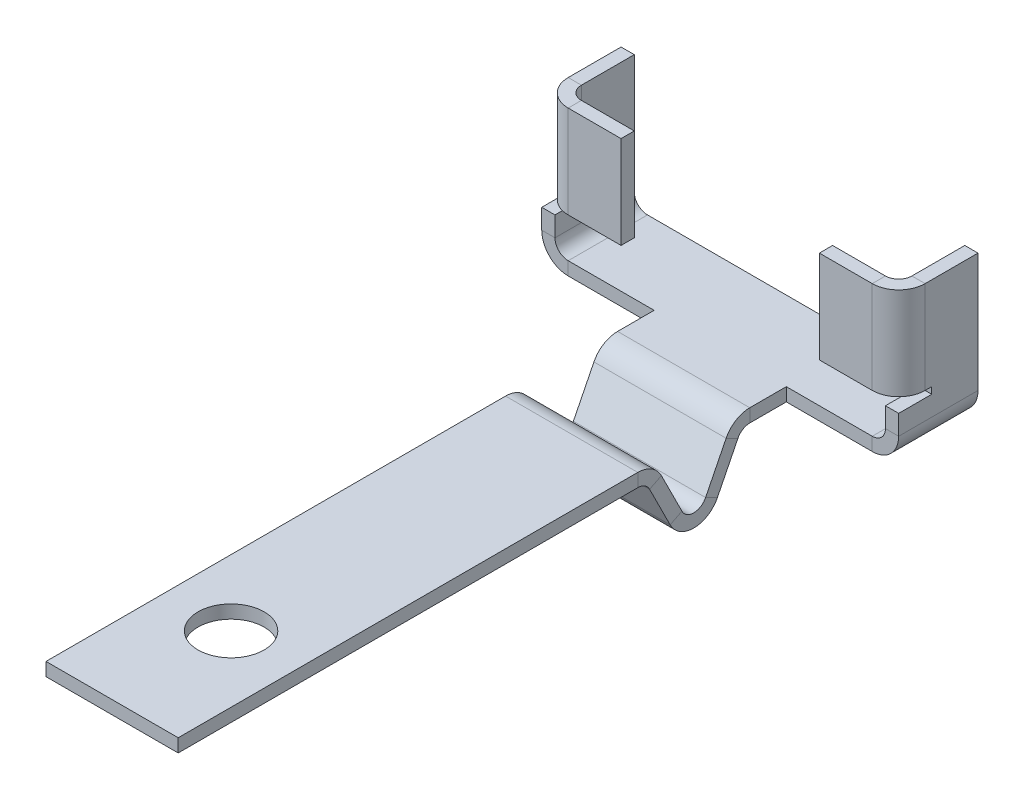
ISO-10303-21;
HEADER;
FILE_DESCRIPTION(('STEP AP214'),'2;1');
FILE_NAME('part.step','',(''),(''),'','','');
FILE_SCHEMA(('AUTOMOTIVE_DESIGN { 1 0 10303 214 1 1 1 1 }'));
ENDSEC;
DATA;
#1=APPLICATION_CONTEXT('core data for automotive mechanical design processes');
#2=APPLICATION_PROTOCOL_DEFINITION('international standard','automotive_design',2000,#1);
#3=PRODUCT_CONTEXT('',#1,'mechanical');
#4=PRODUCT('Part','Part','',(#3));
#5=PRODUCT_RELATED_PRODUCT_CATEGORY('part','',(#4));
#6=PRODUCT_DEFINITION_FORMATION('','',#4);
#7=PRODUCT_DEFINITION_CONTEXT('part definition',#1,'design');
#8=PRODUCT_DEFINITION('design','',#6,#7);
#9=PRODUCT_DEFINITION_SHAPE('','',#8);
#10=(LENGTH_UNIT() NAMED_UNIT(*) SI_UNIT(.MILLI.,.METRE.));
#11=(NAMED_UNIT(*) PLANE_ANGLE_UNIT() SI_UNIT($,.RADIAN.));
#12=(NAMED_UNIT(*) SI_UNIT($,.STERADIAN.) SOLID_ANGLE_UNIT());
#13=UNCERTAINTY_MEASURE_WITH_UNIT(LENGTH_MEASURE(1.E-05),#10,'distance_accuracy_value','');
#14=(GEOMETRIC_REPRESENTATION_CONTEXT(3) GLOBAL_UNCERTAINTY_ASSIGNED_CONTEXT((#13)) GLOBAL_UNIT_ASSIGNED_CONTEXT((#10,
#11,#12)) REPRESENTATION_CONTEXT('',''));
#15=CARTESIAN_POINT('',(0.,0.,0.));
#16=DIRECTION('',(0.,0.,1.));
#17=DIRECTION('',(1.,0.,0.));
#18=AXIS2_PLACEMENT_3D('',#15,#16,#17);
#19=CARTESIAN_POINT('',(-3.75,5.00000000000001,-31.5622577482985));
#20=DIRECTION('',(0.,1.,0.));
#21=DIRECTION('',(0.,0.,1.));
#22=AXIS2_PLACEMENT_3D('',#19,#20,#21);
#23=PLANE('',#22);
#24=DIRECTION('',(1.,0.,0.));
#25=VECTOR('',#24,1.);
#26=CARTESIAN_POINT('',(-6.75,5.00000000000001,-23.));
#27=LINE('',#26,#25);
#28=CARTESIAN_POINT('',(-5.74999999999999,5.00000000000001,-23.));
#29=VERTEX_POINT('',#28);
#30=CARTESIAN_POINT('',(-3.75,5.00000000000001,-23.));
#31=VERTEX_POINT('',#30);
#32=EDGE_CURVE('E352',#29,#31,#27,.T.);
#33=ORIENTED_EDGE('',*,*,#32,.T.);
#34=DIRECTION('',(0.,0.,1.));
#35=VECTOR('',#34,1.);
#36=CARTESIAN_POINT('',(-3.75,5.00000000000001,-31.5622577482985));
#37=LINE('',#36,#35);
#38=CARTESIAN_POINT('',(-3.75,5.00000000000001,-23.5));
#39=VERTEX_POINT('',#38);
#40=EDGE_CURVE('E40',#39,#31,#37,.T.);
#41=ORIENTED_EDGE('',*,*,#40,.F.);
#42=DIRECTION('',(-1.,0.,0.));
#43=VECTOR('',#42,1.);
#44=CARTESIAN_POINT('',(-3.75,5.00000000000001,-23.5));
#45=LINE('',#44,#43);
#46=CARTESIAN_POINT('',(-5.75,5.,-23.5));
#47=VERTEX_POINT('',#46);
#48=EDGE_CURVE('E337',#39,#47,#45,.T.);
#49=ORIENTED_EDGE('',*,*,#48,.T.);
#50=DIRECTION('',(0.,0.,1.));
#51=VECTOR('',#50,1.);
#52=CARTESIAN_POINT('',(-5.75,5.00000000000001,-31.5622577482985));
#53=LINE('',#52,#51);
#54=EDGE_CURVE('E11',#47,#29,#53,.T.);
#55=ORIENTED_EDGE('',*,*,#54,.T.);
#56=EDGE_LOOP('',(#33,#41,#49,#55));
#57=FACE_BOUND('',#56,.T.);
#58=ADVANCED_FACE('F33',(#57),#23,.T.);
#59=CARTESIAN_POINT('',(-3.75,5.00000000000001,-31.5622577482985));
#60=DIRECTION('',(-1.,0.,0.));
#61=DIRECTION('',(0.,1.,0.));
#62=AXIS2_PLACEMENT_3D('',#59,#60,#61);
#63=PLANE('',#62);
#64=ORIENTED_EDGE('',*,*,#40,.T.);
#65=DIRECTION('',(0.,-1.,0.));
#66=VECTOR('',#65,1.);
#67=CARTESIAN_POINT('',(-3.75,5.00000000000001,-23.));
#68=LINE('',#67,#66);
#69=CARTESIAN_POINT('',(-3.75,1.50000000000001,-23.));
#70=VERTEX_POINT('',#69);
#71=EDGE_CURVE('E349',#31,#70,#68,.T.);
#72=ORIENTED_EDGE('',*,*,#71,.T.);
#73=DIRECTION('',(0.,0.,1.));
#74=VECTOR('',#73,1.);
#75=CARTESIAN_POINT('',(-3.75,1.50000000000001,-31.5622577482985));
#76=LINE('',#75,#74);
#77=CARTESIAN_POINT('',(-3.75,1.50000000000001,-23.5));
#78=VERTEX_POINT('',#77);
#79=EDGE_CURVE('E343',#78,#70,#76,.T.);
#80=ORIENTED_EDGE('',*,*,#79,.F.);
#81=DIRECTION('',(0.,1.,0.));
#82=VECTOR('',#81,1.);
#83=CARTESIAN_POINT('',(-3.75,5.00000000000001,-23.5));
#84=LINE('',#83,#82);
#85=EDGE_CURVE('E47',#39,#78,#84,.F.);
#86=ORIENTED_EDGE('',*,*,#85,.F.);
#87=EDGE_LOOP('',(#64,#72,#80,#86));
#88=FACE_BOUND('',#87,.T.);
#89=ADVANCED_FACE('F348',(#88),#63,.F.);
#90=CARTESIAN_POINT('',(-3.75,1.50000000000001,-31.5622577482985));
#91=DIRECTION('',(0.,1.,0.));
#92=DIRECTION('',(0.,0.,1.));
#93=AXIS2_PLACEMENT_3D('',#90,#91,#92);
#94=PLANE('',#93);
#95=ORIENTED_EDGE('',*,*,#79,.T.);
#96=DIRECTION('',(-1.,0.,0.));
#97=VECTOR('',#96,1.);
#98=CARTESIAN_POINT('',(-3.75,1.50000000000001,-23.));
#99=LINE('',#98,#97);
#100=CARTESIAN_POINT('',(-5.75000000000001,1.50000000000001,-23.));
#101=VERTEX_POINT('',#100);
#102=EDGE_CURVE('E353',#70,#101,#99,.T.);
#103=ORIENTED_EDGE('',*,*,#102,.T.);
#104=DIRECTION('',(0.,0.,1.));
#105=VECTOR('',#104,1.);
#106=CARTESIAN_POINT('',(-5.75,1.50000000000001,-31.5622577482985));
#107=LINE('',#106,#105);
#108=CARTESIAN_POINT('',(-5.75,1.50000000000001,-23.5));
#109=VERTEX_POINT('',#108);
#110=EDGE_CURVE('E341',#109,#101,#107,.T.);
#111=ORIENTED_EDGE('',*,*,#110,.F.);
#112=DIRECTION('',(-1.,0.,0.));
#113=VECTOR('',#112,1.);
#114=CARTESIAN_POINT('',(-3.75,1.50000000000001,-23.5));
#115=LINE('',#114,#113);
#116=EDGE_CURVE('E55',#78,#109,#115,.T.);
#117=ORIENTED_EDGE('',*,*,#116,.F.);
#118=EDGE_LOOP('',(#95,#103,#111,#117));
#119=FACE_BOUND('',#118,.T.);
#120=ADVANCED_FACE('F356',(#119),#94,.F.);
#121=CARTESIAN_POINT('',(-3.75,5.00000000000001,-23.5));
#122=DIRECTION('',(0.,0.,-1.));
#123=DIRECTION('',(-1.,0.,0.));
#124=AXIS2_PLACEMENT_3D('',#121,#122,#123);
#125=PLANE('',#124);
#126=DIRECTION('',(0.,-1.,0.));
#127=VECTOR('',#126,1.);
#128=CARTESIAN_POINT('',(-5.75,5.00000000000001,-23.5));
#129=LINE('',#128,#127);
#130=EDGE_CURVE('E328',#47,#109,#129,.T.);
#131=ORIENTED_EDGE('',*,*,#130,.F.);
#132=ORIENTED_EDGE('',*,*,#48,.F.);
#133=ORIENTED_EDGE('',*,*,#85,.T.);
#134=ORIENTED_EDGE('',*,*,#116,.T.);
#135=EDGE_LOOP('',(#131,#132,#133,#134));
#136=FACE_BOUND('',#135,.T.);
#137=ADVANCED_FACE('F340',(#136),#125,.T.);
#138=CARTESIAN_POINT('',(6.75,0.,-23.));
#139=DIRECTION('',(0.,0.,-1.));
#140=DIRECTION('',(-1.,0.,0.));
#141=AXIS2_PLACEMENT_3D('',#138,#139,#140);
#142=PLANE('',#141);
#143=ORIENTED_EDGE('',*,*,#32,.F.);
#144=DIRECTION('',(0.,-1.,0.));
#145=VECTOR('',#144,1.);
#146=CARTESIAN_POINT('',(-5.74999999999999,5.00000000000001,-23.));
#147=LINE('',#146,#145);
#148=EDGE_CURVE('E360',#29,#101,#147,.T.);
#149=ORIENTED_EDGE('',*,*,#148,.T.);
#150=ORIENTED_EDGE('',*,*,#102,.F.);
#151=ORIENTED_EDGE('',*,*,#71,.F.);
#152=EDGE_LOOP('',(#143,#149,#150,#151));
#153=FACE_BOUND('',#152,.T.);
#154=ADVANCED_FACE('F361',(#153),#142,.F.);
#155=CARTESIAN_POINT('',(4.56665382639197,5.00000000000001,-26.));
#156=DIRECTION('',(0.,-1.,0.));
#157=DIRECTION('',(1.,0.,0.));
#158=AXIS2_PLACEMENT_3D('',#155,#156,#157);
#159=PLANE('',#158);
#160=DIRECTION('',(0.,0.,1.));
#161=VECTOR('',#160,1.);
#162=CARTESIAN_POINT('',(-6.75,5.00000000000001,-26.));
#163=LINE('',#162,#161);
#164=CARTESIAN_POINT('',(-6.75,5.00000000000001,-26.));
#165=VERTEX_POINT('',#164);
#166=CARTESIAN_POINT('',(-6.75,5.,-24.));
#167=VERTEX_POINT('',#166);
#168=EDGE_CURVE('E418',#165,#167,#163,.T.);
#169=ORIENTED_EDGE('',*,*,#168,.T.);
#170=DIRECTION('',(-1.,0.,0.));
#171=VECTOR('',#170,1.);
#172=CARTESIAN_POINT('',(4.56665382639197,5.00000000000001,-24.));
#173=LINE('',#172,#171);
#174=CARTESIAN_POINT('',(-6.25,5.,-24.));
#175=VERTEX_POINT('',#174);
#176=EDGE_CURVE('E370',#175,#167,#173,.T.);
#177=ORIENTED_EDGE('',*,*,#176,.F.);
#178=DIRECTION('',(0.,0.,1.));
#179=VECTOR('',#178,1.);
#180=CARTESIAN_POINT('',(-6.25,5.00000000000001,-26.));
#181=LINE('',#180,#179);
#182=CARTESIAN_POINT('',(-6.25,5.00000000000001,-26.));
#183=VERTEX_POINT('',#182);
#184=EDGE_CURVE('E396',#183,#175,#181,.T.);
#185=ORIENTED_EDGE('',*,*,#184,.F.);
#186=DIRECTION('',(-1.,0.,0.));
#187=VECTOR('',#186,1.);
#188=CARTESIAN_POINT('',(4.56665382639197,5.00000000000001,-26.));
#189=LINE('',#188,#187);
#190=EDGE_CURVE('E389',#183,#165,#189,.T.);
#191=ORIENTED_EDGE('',*,*,#190,.T.);
#192=EDGE_LOOP('',(#169,#177,#185,#191));
#193=FACE_BOUND('',#192,.T.);
#194=ADVANCED_FACE('F859',(#193),#159,.F.);
#195=CARTESIAN_POINT('',(4.56665382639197,1.50000000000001,-26.));
#196=DIRECTION('',(0.,1.,0.));
#197=DIRECTION('',(-1.,0.,0.));
#198=AXIS2_PLACEMENT_3D('',#195,#196,#197);
#199=PLANE('',#198);
#200=DIRECTION('',(0.,0.,1.));
#201=VECTOR('',#200,1.);
#202=CARTESIAN_POINT('',(-6.75,1.50000000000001,-26.));
#203=LINE('',#202,#201);
#204=CARTESIAN_POINT('',(-6.75,1.50000000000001,-24.25));
#205=VERTEX_POINT('',#204);
#206=CARTESIAN_POINT('',(-6.75,1.50000000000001,-24.));
#207=VERTEX_POINT('',#206);
#208=EDGE_CURVE('E421',#205,#207,#203,.T.);
#209=ORIENTED_EDGE('',*,*,#208,.F.);
#210=DIRECTION('',(-1.,0.,0.));
#211=VECTOR('',#210,1.);
#212=CARTESIAN_POINT('',(4.56665382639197,1.50000000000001,-24.25));
#213=LINE('',#212,#211);
#214=CARTESIAN_POINT('',(-6.25,1.50000000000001,-24.25));
#215=VERTEX_POINT('',#214);
#216=EDGE_CURVE('E375',#215,#205,#213,.T.);
#217=ORIENTED_EDGE('',*,*,#216,.F.);
#218=DIRECTION('',(0.,0.,-1.));
#219=VECTOR('',#218,1.);
#220=CARTESIAN_POINT('',(-6.25,1.50000000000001,-26.));
#221=LINE('',#220,#219);
#222=CARTESIAN_POINT('',(-6.25,1.50000000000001,-24.));
#223=VERTEX_POINT('',#222);
#224=EDGE_CURVE('E408',#223,#215,#221,.T.);
#225=ORIENTED_EDGE('',*,*,#224,.F.);
#226=DIRECTION('',(-1.,0.,0.));
#227=VECTOR('',#226,1.);
#228=CARTESIAN_POINT('',(4.56665382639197,1.50000000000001,-24.));
#229=LINE('',#228,#227);
#230=EDGE_CURVE('E372',#223,#207,#229,.T.);
#231=ORIENTED_EDGE('',*,*,#230,.T.);
#232=EDGE_LOOP('',(#209,#217,#225,#231));
#233=FACE_BOUND('',#232,.T.);
#234=ADVANCED_FACE('F862',(#233),#199,.F.);
#235=CARTESIAN_POINT('',(4.56665382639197,5.00000000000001,-24.25));
#236=DIRECTION('',(0.,0.,-1.));
#237=DIRECTION('',(0.,1.,0.));
#238=AXIS2_PLACEMENT_3D('',#235,#236,#237);
#239=PLANE('',#238);
#240=DIRECTION('',(0.,1.,0.));
#241=VECTOR('',#240,1.);
#242=CARTESIAN_POINT('',(-6.75,0.,-24.25));
#243=LINE('',#242,#241);
#244=CARTESIAN_POINT('',(-6.75,1.25000000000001,-24.25));
#245=VERTEX_POINT('',#244);
#246=EDGE_CURVE('E426',#245,#205,#243,.T.);
#247=ORIENTED_EDGE('',*,*,#246,.F.);
#248=DIRECTION('',(-1.,0.,0.));
#249=VECTOR('',#248,1.);
#250=CARTESIAN_POINT('',(4.56665382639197,1.25000000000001,-24.25));
#251=LINE('',#250,#249);
#252=CARTESIAN_POINT('',(-6.25,1.25000000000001,-24.25));
#253=VERTEX_POINT('',#252);
#254=EDGE_CURVE('E378',#253,#245,#251,.T.);
#255=ORIENTED_EDGE('',*,*,#254,.F.);
#256=DIRECTION('',(0.,-1.,0.));
#257=VECTOR('',#256,1.);
#258=CARTESIAN_POINT('',(-6.25,5.00000000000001,-24.25));
#259=LINE('',#258,#257);
#260=EDGE_CURVE('E406',#215,#253,#259,.T.);
#261=ORIENTED_EDGE('',*,*,#260,.F.);
#262=ORIENTED_EDGE('',*,*,#216,.T.);
#263=EDGE_LOOP('',(#247,#255,#261,#262));
#264=FACE_BOUND('',#263,.T.);
#265=ADVANCED_FACE('F866',(#264),#239,.F.);
#266=CARTESIAN_POINT('',(4.56665382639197,1.25000000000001,-26.));
#267=DIRECTION('',(0.,-1.,0.));
#268=DIRECTION('',(1.,0.,0.));
#269=AXIS2_PLACEMENT_3D('',#266,#267,#268);
#270=PLANE('',#269);
#271=DIRECTION('',(0.,0.,-1.));
#272=VECTOR('',#271,1.);
#273=CARTESIAN_POINT('',(-6.75,1.25000000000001,-26.));
#274=LINE('',#273,#272);
#275=CARTESIAN_POINT('',(-6.75,1.25000000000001,-23.));
#276=VERTEX_POINT('',#275);
#277=EDGE_CURVE('E415',#276,#245,#274,.T.);
#278=ORIENTED_EDGE('',*,*,#277,.F.);
#279=DIRECTION('',(-1.,0.,0.));
#280=VECTOR('',#279,1.);
#281=CARTESIAN_POINT('',(4.56665382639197,1.25000000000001,-23.));
#282=LINE('',#281,#280);
#283=CARTESIAN_POINT('',(-6.25,1.25000000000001,-23.));
#284=VERTEX_POINT('',#283);
#285=EDGE_CURVE('E381',#284,#276,#282,.T.);
#286=ORIENTED_EDGE('',*,*,#285,.F.);
#287=DIRECTION('',(0.,0.,1.));
#288=VECTOR('',#287,1.);
#289=CARTESIAN_POINT('',(-6.25,1.25000000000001,-26.));
#290=LINE('',#289,#288);
#291=EDGE_CURVE('E404',#253,#284,#290,.T.);
#292=ORIENTED_EDGE('',*,*,#291,.F.);
#293=ORIENTED_EDGE('',*,*,#254,.T.);
#294=EDGE_LOOP('',(#278,#286,#292,#293));
#295=FACE_BOUND('',#294,.T.);
#296=ADVANCED_FACE('F870',(#295),#270,.F.);
#297=CARTESIAN_POINT('',(4.56665382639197,5.00000000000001,-23.));
#298=DIRECTION('',(0.,0.,-1.));
#299=DIRECTION('',(0.,1.,0.));
#300=AXIS2_PLACEMENT_3D('',#297,#298,#299);
#301=PLANE('',#300);
#302=DIRECTION('',(0.,-1.,0.));
#303=VECTOR('',#302,1.);
#304=CARTESIAN_POINT('',(-6.75,0.,-23.));
#305=LINE('',#304,#303);
#306=CARTESIAN_POINT('',(-6.75,0.500000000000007,-23.));
#307=VERTEX_POINT('',#306);
#308=EDGE_CURVE('E417',#276,#307,#305,.T.);
#309=ORIENTED_EDGE('',*,*,#308,.T.);
#310=DIRECTION('',(-1.,0.,0.));
#311=VECTOR('',#310,1.);
#312=CARTESIAN_POINT('',(4.56665382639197,0.500000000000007,-23.));
#313=LINE('',#312,#311);
#314=CARTESIAN_POINT('',(-6.25,0.500000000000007,-23.));
#315=VERTEX_POINT('',#314);
#316=EDGE_CURVE('E384',#315,#307,#313,.T.);
#317=ORIENTED_EDGE('',*,*,#316,.F.);
#318=DIRECTION('',(0.,-1.,0.));
#319=VECTOR('',#318,1.);
#320=CARTESIAN_POINT('',(-6.25,5.00000000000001,-23.));
#321=LINE('',#320,#319);
#322=EDGE_CURVE('E401',#284,#315,#321,.T.);
#323=ORIENTED_EDGE('',*,*,#322,.F.);
#324=ORIENTED_EDGE('',*,*,#285,.T.);
#325=EDGE_LOOP('',(#309,#317,#323,#324));
#326=FACE_BOUND('',#325,.T.);
#327=ADVANCED_FACE('F874',(#326),#301,.F.);
#328=CARTESIAN_POINT('',(4.56665382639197,5.00000000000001,-26.));
#329=DIRECTION('',(0.,0.,-1.));
#330=DIRECTION('',(0.,1.,0.));
#331=AXIS2_PLACEMENT_3D('',#328,#329,#330);
#332=PLANE('',#331);
#333=DIRECTION('',(-1.,0.,0.));
#334=VECTOR('',#333,1.);
#335=CARTESIAN_POINT('',(4.56665382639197,0.500000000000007,-26.));
#336=LINE('',#335,#334);
#337=CARTESIAN_POINT('',(-6.25,0.500000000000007,-26.));
#338=VERTEX_POINT('',#337);
#339=CARTESIAN_POINT('',(-6.75,0.500000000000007,-26.));
#340=VERTEX_POINT('',#339);
#341=EDGE_CURVE('E386',#338,#340,#336,.T.);
#342=ORIENTED_EDGE('',*,*,#341,.T.);
#343=DIRECTION('',(0.,1.,0.));
#344=VECTOR('',#343,1.);
#345=CARTESIAN_POINT('',(-6.75,5.00000000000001,-26.));
#346=LINE('',#345,#344);
#347=EDGE_CURVE('E358',#340,#165,#346,.T.);
#348=ORIENTED_EDGE('',*,*,#347,.T.);
#349=ORIENTED_EDGE('',*,*,#190,.F.);
#350=DIRECTION('',(0.,-1.,0.));
#351=VECTOR('',#350,1.);
#352=CARTESIAN_POINT('',(-6.25,5.00000000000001,-26.));
#353=LINE('',#352,#351);
#354=EDGE_CURVE('E398',#183,#338,#353,.T.);
#355=ORIENTED_EDGE('',*,*,#354,.T.);
#356=EDGE_LOOP('',(#342,#348,#349,#355));
#357=FACE_BOUND('',#356,.T.);
#358=ADVANCED_FACE('F878',(#357),#332,.T.);
#359=CARTESIAN_POINT('',(-6.25,5.00000000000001,-26.));
#360=DIRECTION('',(1.,0.,0.));
#361=DIRECTION('',(0.,0.,-1.));
#362=AXIS2_PLACEMENT_3D('',#359,#360,#361);
#363=PLANE('',#362);
#364=ORIENTED_EDGE('',*,*,#184,.T.);
#365=DIRECTION('',(0.,-1.,0.));
#366=VECTOR('',#365,1.);
#367=CARTESIAN_POINT('',(-6.25,5.00000000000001,-24.));
#368=LINE('',#367,#366);
#369=EDGE_CURVE('E331',#175,#223,#368,.T.);
#370=ORIENTED_EDGE('',*,*,#369,.T.);
#371=ORIENTED_EDGE('',*,*,#224,.T.);
#372=ORIENTED_EDGE('',*,*,#260,.T.);
#373=ORIENTED_EDGE('',*,*,#291,.T.);
#374=ORIENTED_EDGE('',*,*,#322,.T.);
#375=DIRECTION('',(0.,0.,1.));
#376=VECTOR('',#375,1.);
#377=CARTESIAN_POINT('',(-6.25,0.500000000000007,-26.));
#378=LINE('',#377,#376);
#379=EDGE_CURVE('E393',#338,#315,#378,.T.);
#380=ORIENTED_EDGE('',*,*,#379,.F.);
#381=ORIENTED_EDGE('',*,*,#354,.F.);
#382=EDGE_LOOP('',(#364,#370,#371,#372,#373,#374,#380,#381));
#383=FACE_BOUND('',#382,.T.);
#384=ADVANCED_FACE('F882',(#383),#363,.T.);
#385=CARTESIAN_POINT('',(-6.75,0.,-26.));
#386=DIRECTION('',(-1.,0.,0.));
#387=DIRECTION('',(0.,0.,1.));
#388=AXIS2_PLACEMENT_3D('',#385,#386,#387);
#389=PLANE('',#388);
#390=ORIENTED_EDGE('',*,*,#208,.T.);
#391=DIRECTION('',(0.,1.,0.));
#392=VECTOR('',#391,1.);
#393=CARTESIAN_POINT('',(-6.75,5.00000000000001,-24.));
#394=LINE('',#393,#392);
#395=EDGE_CURVE('E410',#207,#167,#394,.T.);
#396=ORIENTED_EDGE('',*,*,#395,.T.);
#397=ORIENTED_EDGE('',*,*,#168,.F.);
#398=ORIENTED_EDGE('',*,*,#347,.F.);
#399=DIRECTION('',(0.,0.,-1.));
#400=VECTOR('',#399,1.);
#401=CARTESIAN_POINT('',(-6.75,0.500000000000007,-26.));
#402=LINE('',#401,#400);
#403=EDGE_CURVE('E413',#307,#340,#402,.T.);
#404=ORIENTED_EDGE('',*,*,#403,.F.);
#405=ORIENTED_EDGE('',*,*,#308,.F.);
#406=ORIENTED_EDGE('',*,*,#277,.T.);
#407=ORIENTED_EDGE('',*,*,#246,.T.);
#408=EDGE_LOOP('',(#390,#396,#397,#398,#404,#405,#406,#407));
#409=FACE_BOUND('',#408,.T.);
#410=ADVANCED_FACE('F886',(#409),#389,.T.);
#411=CARTESIAN_POINT('',(3.75,1.50000000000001,-31.5622577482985));
#412=DIRECTION('',(0.,-1.,0.));
#413=DIRECTION('',(0.,0.,1.));
#414=AXIS2_PLACEMENT_3D('',#411,#412,#413);
#415=PLANE('',#414);
#416=DIRECTION('',(1.,0.,0.));
#417=VECTOR('',#416,1.);
#418=CARTESIAN_POINT('',(3.75,1.50000000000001,-23.));
#419=LINE('',#418,#417);
#420=CARTESIAN_POINT('',(3.75,1.50000000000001,-23.));
#421=VERTEX_POINT('',#420);
#422=CARTESIAN_POINT('',(5.74999999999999,1.50000000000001,-23.));
#423=VERTEX_POINT('',#422);
#424=EDGE_CURVE('E459',#421,#423,#419,.T.);
#425=ORIENTED_EDGE('',*,*,#424,.F.);
#426=DIRECTION('',(0.,0.,1.));
#427=VECTOR('',#426,1.);
#428=CARTESIAN_POINT('',(3.75,1.50000000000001,-31.5622577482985));
#429=LINE('',#428,#427);
#430=CARTESIAN_POINT('',(3.75,1.50000000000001,-23.5));
#431=VERTEX_POINT('',#430);
#432=EDGE_CURVE('E434',#431,#421,#429,.T.);
#433=ORIENTED_EDGE('',*,*,#432,.F.);
#434=DIRECTION('',(1.,0.,0.));
#435=VECTOR('',#434,1.);
#436=CARTESIAN_POINT('',(3.75,1.50000000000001,-23.5));
#437=LINE('',#436,#435);
#438=CARTESIAN_POINT('',(5.75,1.50000000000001,-23.5));
#439=VERTEX_POINT('',#438);
#440=EDGE_CURVE('E448',#431,#439,#437,.T.);
#441=ORIENTED_EDGE('',*,*,#440,.T.);
#442=DIRECTION('',(0.,0.,1.));
#443=VECTOR('',#442,1.);
#444=CARTESIAN_POINT('',(5.75,1.50000000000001,-31.5622577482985));
#445=LINE('',#444,#443);
#446=EDGE_CURVE('E431',#439,#423,#445,.T.);
#447=ORIENTED_EDGE('',*,*,#446,.T.);
#448=EDGE_LOOP('',(#425,#433,#441,#447));
#449=FACE_BOUND('',#448,.T.);
#450=ADVANCED_FACE('F890',(#449),#415,.T.);
#451=CARTESIAN_POINT('',(3.75,5.00000000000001,-31.5622577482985));
#452=DIRECTION('',(-1.,0.,0.));
#453=DIRECTION('',(0.,1.,0.));
#454=AXIS2_PLACEMENT_3D('',#451,#452,#453);
#455=PLANE('',#454);
#456=DIRECTION('',(0.,-1.,0.));
#457=VECTOR('',#456,1.);
#458=CARTESIAN_POINT('',(3.75,5.00000000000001,-23.));
#459=LINE('',#458,#457);
#460=CARTESIAN_POINT('',(3.75,5.00000000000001,-23.));
#461=VERTEX_POINT('',#460);
#462=EDGE_CURVE('E457',#461,#421,#459,.T.);
#463=ORIENTED_EDGE('',*,*,#462,.F.);
#464=DIRECTION('',(0.,0.,1.));
#465=VECTOR('',#464,1.);
#466=CARTESIAN_POINT('',(3.75,5.00000000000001,-31.5622577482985));
#467=LINE('',#466,#465);
#468=CARTESIAN_POINT('',(3.75,5.00000000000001,-23.5));
#469=VERTEX_POINT('',#468);
#470=EDGE_CURVE('E437',#469,#461,#467,.T.);
#471=ORIENTED_EDGE('',*,*,#470,.F.);
#472=DIRECTION('',(0.,1.,0.));
#473=VECTOR('',#472,1.);
#474=CARTESIAN_POINT('',(3.75,5.00000000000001,-23.5));
#475=LINE('',#474,#473);
#476=EDGE_CURVE('E445',#469,#431,#475,.F.);
#477=ORIENTED_EDGE('',*,*,#476,.T.);
#478=ORIENTED_EDGE('',*,*,#432,.T.);
#479=EDGE_LOOP('',(#463,#471,#477,#478));
#480=FACE_BOUND('',#479,.T.);
#481=ADVANCED_FACE('F894',(#480),#455,.T.);
#482=CARTESIAN_POINT('',(3.75,5.00000000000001,-31.5622577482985));
#483=DIRECTION('',(0.,-1.,0.));
#484=DIRECTION('',(0.,0.,1.));
#485=AXIS2_PLACEMENT_3D('',#482,#483,#484);
#486=PLANE('',#485);
#487=ORIENTED_EDGE('',*,*,#470,.T.);
#488=DIRECTION('',(1.,0.,0.));
#489=VECTOR('',#488,1.);
#490=CARTESIAN_POINT('',(3.75,5.00000000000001,-23.));
#491=LINE('',#490,#489);
#492=CARTESIAN_POINT('',(5.75000000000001,5.,-23.));
#493=VERTEX_POINT('',#492);
#494=EDGE_CURVE('E428',#461,#493,#491,.T.);
#495=ORIENTED_EDGE('',*,*,#494,.T.);
#496=DIRECTION('',(0.,0.,1.));
#497=VECTOR('',#496,1.);
#498=CARTESIAN_POINT('',(5.75,5.00000000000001,-31.5622577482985));
#499=LINE('',#498,#497);
#500=CARTESIAN_POINT('',(5.75,5.,-23.5));
#501=VERTEX_POINT('',#500);
#502=EDGE_CURVE('E440',#501,#493,#499,.T.);
#503=ORIENTED_EDGE('',*,*,#502,.F.);
#504=DIRECTION('',(1.,0.,0.));
#505=VECTOR('',#504,1.);
#506=CARTESIAN_POINT('',(3.75,5.00000000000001,-23.5));
#507=LINE('',#506,#505);
#508=EDGE_CURVE('E451',#469,#501,#507,.T.);
#509=ORIENTED_EDGE('',*,*,#508,.F.);
#510=EDGE_LOOP('',(#487,#495,#503,#509));
#511=FACE_BOUND('',#510,.T.);
#512=ADVANCED_FACE('F898',(#511),#486,.F.);
#513=CARTESIAN_POINT('',(3.75,5.00000000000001,-23.5));
#514=DIRECTION('',(0.,0.,1.));
#515=DIRECTION('',(1.,0.,0.));
#516=AXIS2_PLACEMENT_3D('',#513,#514,#515);
#517=PLANE('',#516);
#518=ORIENTED_EDGE('',*,*,#508,.T.);
#519=DIRECTION('',(0.,-1.,0.));
#520=VECTOR('',#519,1.);
#521=CARTESIAN_POINT('',(5.75,1.50000000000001,-23.5));
#522=LINE('',#521,#520);
#523=EDGE_CURVE('E442',#501,#439,#522,.T.);
#524=ORIENTED_EDGE('',*,*,#523,.T.);
#525=ORIENTED_EDGE('',*,*,#440,.F.);
#526=ORIENTED_EDGE('',*,*,#476,.F.);
#527=EDGE_LOOP('',(#518,#524,#525,#526));
#528=FACE_BOUND('',#527,.T.);
#529=ADVANCED_FACE('F902',(#528),#517,.F.);
#530=CARTESIAN_POINT('',(6.75,0.,-23.));
#531=DIRECTION('',(0.,0.,-1.));
#532=DIRECTION('',(-1.,0.,0.));
#533=AXIS2_PLACEMENT_3D('',#530,#531,#532);
#534=PLANE('',#533);
#535=ORIENTED_EDGE('',*,*,#424,.T.);
#536=DIRECTION('',(0.,1.,0.));
#537=VECTOR('',#536,1.);
#538=CARTESIAN_POINT('',(5.74999999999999,1.50000000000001,-23.));
#539=LINE('',#538,#537);
#540=EDGE_CURVE('E454',#423,#493,#539,.T.);
#541=ORIENTED_EDGE('',*,*,#540,.T.);
#542=ORIENTED_EDGE('',*,*,#494,.F.);
#543=ORIENTED_EDGE('',*,*,#462,.T.);
#544=EDGE_LOOP('',(#535,#541,#542,#543));
#545=FACE_BOUND('',#544,.T.);
#546=ADVANCED_FACE('F906',(#545),#534,.F.);
#547=CARTESIAN_POINT('',(-4.56665382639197,1.50000000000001,-26.));
#548=DIRECTION('',(0.,-1.,0.));
#549=DIRECTION('',(1.,0.,0.));
#550=AXIS2_PLACEMENT_3D('',#547,#548,#549);
#551=PLANE('',#550);
#552=DIRECTION('',(0.,0.,1.));
#553=VECTOR('',#552,1.);
#554=CARTESIAN_POINT('',(6.75,1.50000000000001,-26.));
#555=LINE('',#554,#553);
#556=CARTESIAN_POINT('',(6.75,1.50000000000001,-24.25));
#557=VERTEX_POINT('',#556);
#558=CARTESIAN_POINT('',(6.75,1.50000000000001,-24.));
#559=VERTEX_POINT('',#558);
#560=EDGE_CURVE('E512',#557,#559,#555,.T.);
#561=ORIENTED_EDGE('',*,*,#560,.T.);
#562=DIRECTION('',(1.,0.,0.));
#563=VECTOR('',#562,1.);
#564=CARTESIAN_POINT('',(-4.56665382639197,1.50000000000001,-24.));
#565=LINE('',#564,#563);
#566=CARTESIAN_POINT('',(6.25,1.50000000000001,-24.));
#567=VERTEX_POINT('',#566);
#568=EDGE_CURVE('E462',#567,#559,#565,.T.);
#569=ORIENTED_EDGE('',*,*,#568,.F.);
#570=DIRECTION('',(0.,0.,-1.));
#571=VECTOR('',#570,1.);
#572=CARTESIAN_POINT('',(6.25,1.50000000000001,-26.));
#573=LINE('',#572,#571);
#574=CARTESIAN_POINT('',(6.25,1.50000000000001,-24.25));
#575=VERTEX_POINT('',#574);
#576=EDGE_CURVE('E498',#567,#575,#573,.T.);
#577=ORIENTED_EDGE('',*,*,#576,.T.);
#578=DIRECTION('',(1.,0.,0.));
#579=VECTOR('',#578,1.);
#580=CARTESIAN_POINT('',(-4.56665382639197,1.50000000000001,-24.25));
#581=LINE('',#580,#579);
#582=EDGE_CURVE('E480',#575,#557,#581,.T.);
#583=ORIENTED_EDGE('',*,*,#582,.T.);
#584=EDGE_LOOP('',(#561,#569,#577,#583));
#585=FACE_BOUND('',#584,.T.);
#586=ADVANCED_FACE('F910',(#585),#551,.T.);
#587=CARTESIAN_POINT('',(-4.56665382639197,5.00000000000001,-26.));
#588=DIRECTION('',(0.,1.,0.));
#589=DIRECTION('',(-1.,0.,0.));
#590=AXIS2_PLACEMENT_3D('',#587,#588,#589);
#591=PLANE('',#590);
#592=DIRECTION('',(0.,0.,1.));
#593=VECTOR('',#592,1.);
#594=CARTESIAN_POINT('',(6.75,5.00000000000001,-26.));
#595=LINE('',#594,#593);
#596=CARTESIAN_POINT('',(6.75,5.00000000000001,-26.));
#597=VERTEX_POINT('',#596);
#598=CARTESIAN_POINT('',(6.75,5.00000000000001,-24.));
#599=VERTEX_POINT('',#598);
#600=EDGE_CURVE('E515',#597,#599,#595,.T.);
#601=ORIENTED_EDGE('',*,*,#600,.F.);
#602=DIRECTION('',(1.,0.,0.));
#603=VECTOR('',#602,1.);
#604=CARTESIAN_POINT('',(-4.56665382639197,5.00000000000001,-26.));
#605=LINE('',#604,#603);
#606=CARTESIAN_POINT('',(6.25,5.00000000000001,-26.));
#607=VERTEX_POINT('',#606);
#608=EDGE_CURVE('E467',#607,#597,#605,.T.);
#609=ORIENTED_EDGE('',*,*,#608,.F.);
#610=DIRECTION('',(0.,0.,1.));
#611=VECTOR('',#610,1.);
#612=CARTESIAN_POINT('',(6.25,5.00000000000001,-26.));
#613=LINE('',#612,#611);
#614=CARTESIAN_POINT('',(6.25,5.,-24.));
#615=VERTEX_POINT('',#614);
#616=EDGE_CURVE('E495',#607,#615,#613,.T.);
#617=ORIENTED_EDGE('',*,*,#616,.T.);
#618=DIRECTION('',(1.,0.,0.));
#619=VECTOR('',#618,1.);
#620=CARTESIAN_POINT('',(-4.56665382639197,5.00000000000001,-24.));
#621=LINE('',#620,#619);
#622=EDGE_CURVE('E464',#615,#599,#621,.T.);
#623=ORIENTED_EDGE('',*,*,#622,.T.);
#624=EDGE_LOOP('',(#601,#609,#617,#623));
#625=FACE_BOUND('',#624,.T.);
#626=ADVANCED_FACE('F914',(#625),#591,.T.);
#627=CARTESIAN_POINT('',(-4.56665382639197,5.00000000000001,-26.));
#628=DIRECTION('',(0.,0.,1.));
#629=DIRECTION('',(0.,1.,0.));
#630=AXIS2_PLACEMENT_3D('',#627,#628,#629);
#631=PLANE('',#630);
#632=ORIENTED_EDGE('',*,*,#608,.T.);
#633=DIRECTION('',(0.,1.,0.));
#634=VECTOR('',#633,1.);
#635=CARTESIAN_POINT('',(6.75,0.,-26.));
#636=LINE('',#635,#634);
#637=CARTESIAN_POINT('',(6.75,0.500000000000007,-26.));
#638=VERTEX_POINT('',#637);
#639=EDGE_CURVE('E518',#638,#597,#636,.T.);
#640=ORIENTED_EDGE('',*,*,#639,.F.);
#641=DIRECTION('',(1.,0.,0.));
#642=VECTOR('',#641,1.);
#643=CARTESIAN_POINT('',(-4.56665382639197,0.500000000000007,-26.));
#644=LINE('',#643,#642);
#645=CARTESIAN_POINT('',(6.25,0.500000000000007,-26.));
#646=VERTEX_POINT('',#645);
#647=EDGE_CURVE('E470',#646,#638,#644,.T.);
#648=ORIENTED_EDGE('',*,*,#647,.F.);
#649=DIRECTION('',(0.,-1.,0.));
#650=VECTOR('',#649,1.);
#651=CARTESIAN_POINT('',(6.25,5.00000000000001,-26.));
#652=LINE('',#651,#650);
#653=EDGE_CURVE('E492',#607,#646,#652,.T.);
#654=ORIENTED_EDGE('',*,*,#653,.F.);
#655=EDGE_LOOP('',(#632,#640,#648,#654));
#656=FACE_BOUND('',#655,.T.);
#657=ADVANCED_FACE('F918',(#656),#631,.F.);
#658=CARTESIAN_POINT('',(-4.56665382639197,5.00000000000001,-23.));
#659=DIRECTION('',(0.,0.,1.));
#660=DIRECTION('',(0.,1.,0.));
#661=AXIS2_PLACEMENT_3D('',#658,#659,#660);
#662=PLANE('',#661);
#663=DIRECTION('',(0.,-1.,0.));
#664=VECTOR('',#663,1.);
#665=CARTESIAN_POINT('',(6.75,0.,-23.));
#666=LINE('',#665,#664);
#667=CARTESIAN_POINT('',(6.75,1.25000000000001,-23.));
#668=VERTEX_POINT('',#667);
#669=CARTESIAN_POINT('',(6.75,0.500000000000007,-23.));
#670=VERTEX_POINT('',#669);
#671=EDGE_CURVE('E521',#668,#670,#666,.T.);
#672=ORIENTED_EDGE('',*,*,#671,.F.);
#673=DIRECTION('',(1.,0.,0.));
#674=VECTOR('',#673,1.);
#675=CARTESIAN_POINT('',(-4.56665382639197,1.25000000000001,-23.));
#676=LINE('',#675,#674);
#677=CARTESIAN_POINT('',(6.25,1.25000000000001,-23.));
#678=VERTEX_POINT('',#677);
#679=EDGE_CURVE('E475',#678,#668,#676,.T.);
#680=ORIENTED_EDGE('',*,*,#679,.F.);
#681=DIRECTION('',(0.,-1.,0.));
#682=VECTOR('',#681,1.);
#683=CARTESIAN_POINT('',(6.25,5.00000000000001,-23.));
#684=LINE('',#683,#682);
#685=CARTESIAN_POINT('',(6.25,0.500000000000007,-23.));
#686=VERTEX_POINT('',#685);
#687=EDGE_CURVE('E489',#678,#686,#684,.T.);
#688=ORIENTED_EDGE('',*,*,#687,.T.);
#689=DIRECTION('',(1.,0.,0.));
#690=VECTOR('',#689,1.);
#691=CARTESIAN_POINT('',(-4.56665382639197,0.500000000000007,-23.));
#692=LINE('',#691,#690);
#693=EDGE_CURVE('E472',#686,#670,#692,.T.);
#694=ORIENTED_EDGE('',*,*,#693,.T.);
#695=EDGE_LOOP('',(#672,#680,#688,#694));
#696=FACE_BOUND('',#695,.T.);
#697=ADVANCED_FACE('F922',(#696),#662,.T.);
#698=CARTESIAN_POINT('',(-4.56665382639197,1.25000000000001,-26.));
#699=DIRECTION('',(0.,1.,0.));
#700=DIRECTION('',(-1.,0.,0.));
#701=AXIS2_PLACEMENT_3D('',#698,#699,#700);
#702=PLANE('',#701);
#703=DIRECTION('',(0.,0.,-1.));
#704=VECTOR('',#703,1.);
#705=CARTESIAN_POINT('',(6.75,1.25000000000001,-26.));
#706=LINE('',#705,#704);
#707=CARTESIAN_POINT('',(6.75,1.25000000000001,-24.25));
#708=VERTEX_POINT('',#707);
#709=EDGE_CURVE('E524',#668,#708,#706,.T.);
#710=ORIENTED_EDGE('',*,*,#709,.T.);
#711=DIRECTION('',(1.,0.,0.));
#712=VECTOR('',#711,1.);
#713=CARTESIAN_POINT('',(-4.56665382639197,1.25000000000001,-24.25));
#714=LINE('',#713,#712);
#715=CARTESIAN_POINT('',(6.25,1.25000000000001,-24.25));
#716=VERTEX_POINT('',#715);
#717=EDGE_CURVE('E478',#716,#708,#714,.T.);
#718=ORIENTED_EDGE('',*,*,#717,.F.);
#719=DIRECTION('',(0.,0.,1.));
#720=VECTOR('',#719,1.);
#721=CARTESIAN_POINT('',(6.25,1.25000000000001,-26.));
#722=LINE('',#721,#720);
#723=EDGE_CURVE('E503',#716,#678,#722,.T.);
#724=ORIENTED_EDGE('',*,*,#723,.T.);
#725=ORIENTED_EDGE('',*,*,#679,.T.);
#726=EDGE_LOOP('',(#710,#718,#724,#725));
#727=FACE_BOUND('',#726,.T.);
#728=ADVANCED_FACE('F926',(#727),#702,.T.);
#729=CARTESIAN_POINT('',(-4.56665382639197,5.00000000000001,-24.25));
#730=DIRECTION('',(0.,0.,1.));
#731=DIRECTION('',(0.,1.,0.));
#732=AXIS2_PLACEMENT_3D('',#729,#730,#731);
#733=PLANE('',#732);
#734=DIRECTION('',(0.,1.,0.));
#735=VECTOR('',#734,1.);
#736=CARTESIAN_POINT('',(6.75,0.,-24.25));
#737=LINE('',#736,#735);
#738=EDGE_CURVE('E510',#708,#557,#737,.T.);
#739=ORIENTED_EDGE('',*,*,#738,.T.);
#740=ORIENTED_EDGE('',*,*,#582,.F.);
#741=DIRECTION('',(0.,-1.,0.));
#742=VECTOR('',#741,1.);
#743=CARTESIAN_POINT('',(6.25,5.00000000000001,-24.25));
#744=LINE('',#743,#742);
#745=EDGE_CURVE('E501',#575,#716,#744,.T.);
#746=ORIENTED_EDGE('',*,*,#745,.T.);
#747=ORIENTED_EDGE('',*,*,#717,.T.);
#748=EDGE_LOOP('',(#739,#740,#746,#747));
#749=FACE_BOUND('',#748,.T.);
#750=ADVANCED_FACE('F930',(#749),#733,.T.);
#751=CARTESIAN_POINT('',(6.25,5.00000000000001,-26.));
#752=DIRECTION('',(1.,0.,0.));
#753=DIRECTION('',(0.,0.,-1.));
#754=AXIS2_PLACEMENT_3D('',#751,#752,#753);
#755=PLANE('',#754);
#756=DIRECTION('',(0.,-1.,0.));
#757=VECTOR('',#756,1.);
#758=CARTESIAN_POINT('',(6.25,1.50000000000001,-24.));
#759=LINE('',#758,#757);
#760=EDGE_CURVE('E483',#615,#567,#759,.T.);
#761=ORIENTED_EDGE('',*,*,#760,.F.);
#762=ORIENTED_EDGE('',*,*,#616,.F.);
#763=ORIENTED_EDGE('',*,*,#653,.T.);
#764=DIRECTION('',(0.,0.,1.));
#765=VECTOR('',#764,1.);
#766=CARTESIAN_POINT('',(6.25,0.500000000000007,-23.));
#767=LINE('',#766,#765);
#768=EDGE_CURVE('E486',#646,#686,#767,.T.);
#769=ORIENTED_EDGE('',*,*,#768,.T.);
#770=ORIENTED_EDGE('',*,*,#687,.F.);
#771=ORIENTED_EDGE('',*,*,#723,.F.);
#772=ORIENTED_EDGE('',*,*,#745,.F.);
#773=ORIENTED_EDGE('',*,*,#576,.F.);
#774=EDGE_LOOP('',(#761,#762,#763,#769,#770,#771,#772,#773));
#775=FACE_BOUND('',#774,.T.);
#776=ADVANCED_FACE('F934',(#775),#755,.F.);
#777=CARTESIAN_POINT('',(6.75,0.,-26.));
#778=DIRECTION('',(-1.,0.,0.));
#779=DIRECTION('',(0.,0.,1.));
#780=AXIS2_PLACEMENT_3D('',#777,#778,#779);
#781=PLANE('',#780);
#782=DIRECTION('',(0.,1.,0.));
#783=VECTOR('',#782,1.);
#784=CARTESIAN_POINT('',(6.75,1.50000000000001,-24.));
#785=LINE('',#784,#783);
#786=EDGE_CURVE('E505',#559,#599,#785,.T.);
#787=ORIENTED_EDGE('',*,*,#786,.F.);
#788=ORIENTED_EDGE('',*,*,#560,.F.);
#789=ORIENTED_EDGE('',*,*,#738,.F.);
#790=ORIENTED_EDGE('',*,*,#709,.F.);
#791=ORIENTED_EDGE('',*,*,#671,.T.);
#792=DIRECTION('',(0.,0.,-1.));
#793=VECTOR('',#792,1.);
#794=CARTESIAN_POINT('',(6.75,0.500000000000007,-23.));
#795=LINE('',#794,#793);
#796=EDGE_CURVE('E507',#670,#638,#795,.T.);
#797=ORIENTED_EDGE('',*,*,#796,.T.);
#798=ORIENTED_EDGE('',*,*,#639,.T.);
#799=ORIENTED_EDGE('',*,*,#600,.T.);
#800=EDGE_LOOP('',(#787,#788,#789,#790,#791,#797,#798,#799));
#801=FACE_BOUND('',#800,.T.);
#802=ADVANCED_FACE('F938',(#801),#781,.F.);
#803=CARTESIAN_POINT('',(2.5,-24.6131368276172,-26.));
#804=DIRECTION('',(0.,0.,-1.));
#805=DIRECTION('',(-1.,0.,0.));
#806=AXIS2_PLACEMENT_3D('',#803,#804,#805);
#807=PLANE('',#806);
#808=DIRECTION('',(0.,1.,0.));
#809=VECTOR('',#808,1.);
#810=CARTESIAN_POINT('',(-5.75,-24.6131368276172,-26.));
#811=LINE('',#810,#809);
#812=CARTESIAN_POINT('',(-5.75,-0.499999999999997,-26.));
#813=VERTEX_POINT('',#812);
#814=CARTESIAN_POINT('',(-5.75,0.,-26.));
#815=VERTEX_POINT('',#814);
#816=EDGE_CURVE('E527',#813,#815,#811,.T.);
#817=ORIENTED_EDGE('',*,*,#816,.T.);
#818=DIRECTION('',(-1.,0.,0.));
#819=VECTOR('',#818,1.);
#820=CARTESIAN_POINT('',(2.5,0.,-26.));
#821=LINE('',#820,#819);
#822=CARTESIAN_POINT('',(5.75,0.,-26.));
#823=VERTEX_POINT('',#822);
#824=EDGE_CURVE('E573',#823,#815,#821,.T.);
#825=ORIENTED_EDGE('',*,*,#824,.F.);
#826=DIRECTION('',(0.,1.,0.));
#827=VECTOR('',#826,1.);
#828=CARTESIAN_POINT('',(5.75,-24.6131368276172,-26.));
#829=LINE('',#828,#827);
#830=CARTESIAN_POINT('',(5.75,-0.499999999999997,-26.));
#831=VERTEX_POINT('',#830);
#832=EDGE_CURVE('E529',#831,#823,#829,.T.);
#833=ORIENTED_EDGE('',*,*,#832,.F.);
#834=DIRECTION('',(-1.,0.,0.));
#835=VECTOR('',#834,1.);
#836=CARTESIAN_POINT('',(2.5,-0.499999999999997,-26.));
#837=LINE('',#836,#835);
#838=EDGE_CURVE('E562',#831,#813,#837,.T.);
#839=ORIENTED_EDGE('',*,*,#838,.T.);
#840=EDGE_LOOP('',(#817,#825,#833,#839));
#841=FACE_BOUND('',#840,.T.);
#842=ADVANCED_FACE('F942',(#841),#807,.T.);
#843=CARTESIAN_POINT('',(6.75,-24.6131368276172,-23.));
#844=DIRECTION('',(0.,0.,-1.));
#845=DIRECTION('',(-1.,0.,0.));
#846=AXIS2_PLACEMENT_3D('',#843,#844,#845);
#847=PLANE('',#846);
#848=DIRECTION('',(-1.,0.,0.));
#849=VECTOR('',#848,1.);
#850=CARTESIAN_POINT('',(6.75,0.,-23.));
#851=LINE('',#850,#849);
#852=CARTESIAN_POINT('',(5.75,0.,-23.));
#853=VERTEX_POINT('',#852);
#854=CARTESIAN_POINT('',(2.5,0.,-23.));
#855=VERTEX_POINT('',#854);
#856=EDGE_CURVE('E576',#853,#855,#851,.T.);
#857=ORIENTED_EDGE('',*,*,#856,.T.);
#858=DIRECTION('',(0.,1.,0.));
#859=VECTOR('',#858,1.);
#860=CARTESIAN_POINT('',(2.5,-24.6131368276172,-23.));
#861=LINE('',#860,#859);
#862=CARTESIAN_POINT('',(2.5,-0.499999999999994,-23.));
#863=VERTEX_POINT('',#862);
#864=EDGE_CURVE('E534',#863,#855,#861,.T.);
#865=ORIENTED_EDGE('',*,*,#864,.F.);
#866=DIRECTION('',(-1.,0.,0.));
#867=VECTOR('',#866,1.);
#868=CARTESIAN_POINT('',(6.75,-0.499999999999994,-23.));
#869=LINE('',#868,#867);
#870=CARTESIAN_POINT('',(5.75,-0.499999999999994,-23.));
#871=VERTEX_POINT('',#870);
#872=EDGE_CURVE('E560',#871,#863,#869,.T.);
#873=ORIENTED_EDGE('',*,*,#872,.F.);
#874=DIRECTION('',(0.,1.,0.));
#875=VECTOR('',#874,1.);
#876=CARTESIAN_POINT('',(5.75,-24.6131368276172,-23.));
#877=LINE('',#876,#875);
#878=EDGE_CURVE('E532',#871,#853,#877,.T.);
#879=ORIENTED_EDGE('',*,*,#878,.T.);
#880=EDGE_LOOP('',(#857,#865,#873,#879));
#881=FACE_BOUND('',#880,.T.);
#882=ADVANCED_FACE('F946',(#881),#847,.F.);
#883=CARTESIAN_POINT('',(2.5,-24.6131368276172,-21.));
#884=DIRECTION('',(1.,0.,0.));
#885=DIRECTION('',(0.,0.,-1.));
#886=AXIS2_PLACEMENT_3D('',#883,#884,#885);
#887=PLANE('',#886);
#888=ORIENTED_EDGE('',*,*,#864,.T.);
#889=DIRECTION('',(0.,0.,-1.));
#890=VECTOR('',#889,1.);
#891=CARTESIAN_POINT('',(2.5,0.,-21.));
#892=LINE('',#891,#890);
#893=CARTESIAN_POINT('',(2.5,0.,-21.6180339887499));
#894=VERTEX_POINT('',#893);
#895=EDGE_CURVE('E577',#894,#855,#892,.T.);
#896=ORIENTED_EDGE('',*,*,#895,.F.);
#897=DIRECTION('',(0.,1.,0.));
#898=VECTOR('',#897,1.);
#899=CARTESIAN_POINT('',(2.5,-24.6131368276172,-21.6180339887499));
#900=LINE('',#899,#898);
#901=CARTESIAN_POINT('',(2.5,-0.500000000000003,-21.6180339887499));
#902=VERTEX_POINT('',#901);
#903=EDGE_CURVE('E537',#902,#894,#900,.T.);
#904=ORIENTED_EDGE('',*,*,#903,.F.);
#905=DIRECTION('',(0.,0.,-1.));
#906=VECTOR('',#905,1.);
#907=CARTESIAN_POINT('',(2.5,-0.499999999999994,-21.));
#908=LINE('',#907,#906);
#909=EDGE_CURVE('E557',#902,#863,#908,.T.);
#910=ORIENTED_EDGE('',*,*,#909,.T.);
#911=EDGE_LOOP('',(#888,#896,#904,#910));
#912=FACE_BOUND('',#911,.T.);
#913=ADVANCED_FACE('F948',(#912),#887,.T.);
#914=CARTESIAN_POINT('',(-2.5,-24.6131368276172,-21.));
#915=DIRECTION('',(1.,0.,0.));
#916=DIRECTION('',(0.,0.,-1.));
#917=AXIS2_PLACEMENT_3D('',#914,#915,#916);
#918=PLANE('',#917);
#919=DIRECTION('',(0.,0.,-1.));
#920=VECTOR('',#919,1.);
#921=CARTESIAN_POINT('',(-2.5,0.,-21.));
#922=LINE('',#921,#920);
#923=CARTESIAN_POINT('',(-2.5,0.,-21.6180339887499));
#924=VERTEX_POINT('',#923);
#925=CARTESIAN_POINT('',(-2.5,0.,-23.));
#926=VERTEX_POINT('',#925);
#927=EDGE_CURVE('E580',#924,#926,#922,.T.);
#928=ORIENTED_EDGE('',*,*,#927,.T.);
#929=DIRECTION('',(0.,1.,0.));
#930=VECTOR('',#929,1.);
#931=CARTESIAN_POINT('',(-2.5,-24.6131368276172,-23.));
#932=LINE('',#931,#930);
#933=CARTESIAN_POINT('',(-2.5,-0.499999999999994,-23.));
#934=VERTEX_POINT('',#933);
#935=EDGE_CURVE('E542',#934,#926,#932,.T.);
#936=ORIENTED_EDGE('',*,*,#935,.F.);
#937=DIRECTION('',(0.,0.,-1.));
#938=VECTOR('',#937,1.);
#939=CARTESIAN_POINT('',(-2.5,-0.499999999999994,-21.));
#940=LINE('',#939,#938);
#941=CARTESIAN_POINT('',(-2.5,-0.500000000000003,-21.6180339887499));
#942=VERTEX_POINT('',#941);
#943=EDGE_CURVE('E555',#942,#934,#940,.T.);
#944=ORIENTED_EDGE('',*,*,#943,.F.);
#945=DIRECTION('',(0.,1.,0.));
#946=VECTOR('',#945,1.);
#947=CARTESIAN_POINT('',(-2.5,-24.6131368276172,-21.6180339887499));
#948=LINE('',#947,#946);
#949=EDGE_CURVE('E539',#942,#924,#948,.T.);
#950=ORIENTED_EDGE('',*,*,#949,.T.);
#951=EDGE_LOOP('',(#928,#936,#944,#950));
#952=FACE_BOUND('',#951,.T.);
#953=ADVANCED_FACE('F951',(#952),#918,.F.);
#954=CARTESIAN_POINT('',(-5.75,0.,-23.));
#955=VERTEX_POINT('',#954);
#956=EDGE_CURVE('E583',#926,#955,#851,.T.);
#957=ORIENTED_EDGE('',*,*,#956,.T.);
#958=DIRECTION('',(0.,1.,0.));
#959=VECTOR('',#958,1.);
#960=CARTESIAN_POINT('',(-5.75,-24.6131368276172,-23.));
#961=LINE('',#960,#959);
#962=CARTESIAN_POINT('',(-5.75,-0.499999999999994,-23.));
#963=VERTEX_POINT('',#962);
#964=EDGE_CURVE('E544',#963,#955,#961,.T.);
#965=ORIENTED_EDGE('',*,*,#964,.F.);
#966=EDGE_CURVE('E554',#934,#963,#869,.T.);
#967=ORIENTED_EDGE('',*,*,#966,.F.);
#968=ORIENTED_EDGE('',*,*,#935,.T.);
#969=EDGE_LOOP('',(#957,#965,#967,#968));
#970=FACE_BOUND('',#969,.T.);
#971=ADVANCED_FACE('F955',(#970),#847,.F.);
#972=CARTESIAN_POINT('',(2.5,-0.499999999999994,-21.));
#973=DIRECTION('',(0.,1.,0.));
#974=DIRECTION('',(0.,0.,1.));
#975=AXIS2_PLACEMENT_3D('',#972,#973,#974);
#976=PLANE('',#975);
#977=ORIENTED_EDGE('',*,*,#966,.T.);
#978=DIRECTION('',(0.,0.,-1.));
#979=VECTOR('',#978,1.);
#980=CARTESIAN_POINT('',(-5.75,-0.499999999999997,-26.));
#981=LINE('',#980,#979);
#982=EDGE_CURVE('E547',#963,#813,#981,.T.);
#983=ORIENTED_EDGE('',*,*,#982,.T.);
#984=ORIENTED_EDGE('',*,*,#838,.F.);
#985=DIRECTION('',(0.,0.,1.));
#986=VECTOR('',#985,1.);
#987=CARTESIAN_POINT('',(5.75,-0.499999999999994,-23.));
#988=LINE('',#987,#986);
#989=EDGE_CURVE('E549',#831,#871,#988,.T.);
#990=ORIENTED_EDGE('',*,*,#989,.T.);
#991=ORIENTED_EDGE('',*,*,#872,.T.);
#992=ORIENTED_EDGE('',*,*,#909,.F.);
#993=DIRECTION('',(-1.,0.,0.));
#994=VECTOR('',#993,1.);
#995=CARTESIAN_POINT('',(-2.5,-0.499999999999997,-21.6180339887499));
#996=LINE('',#995,#994);
#997=EDGE_CURVE('E551',#902,#942,#996,.T.);
#998=ORIENTED_EDGE('',*,*,#997,.T.);
#999=ORIENTED_EDGE('',*,*,#943,.T.);
#1000=EDGE_LOOP('',(#977,#983,#984,#990,#991,#992,#998,#999));
#1001=FACE_BOUND('',#1000,.T.);
#1002=ADVANCED_FACE('F960',(#1001),#976,.F.);
#1003=CARTESIAN_POINT('',(2.5,0.,-21.));
#1004=DIRECTION('',(0.,1.,0.));
#1005=DIRECTION('',(0.,0.,1.));
#1006=AXIS2_PLACEMENT_3D('',#1003,#1004,#1005);
#1007=PLANE('',#1006);
#1008=DIRECTION('',(0.,0.,-1.));
#1009=VECTOR('',#1008,1.);
#1010=CARTESIAN_POINT('',(-5.75,0.,-26.));
#1011=LINE('',#1010,#1009);
#1012=EDGE_CURVE('E565',#955,#815,#1011,.T.);
#1013=ORIENTED_EDGE('',*,*,#1012,.F.);
#1014=ORIENTED_EDGE('',*,*,#956,.F.);
#1015=ORIENTED_EDGE('',*,*,#927,.F.);
#1016=DIRECTION('',(-1.,0.,0.));
#1017=VECTOR('',#1016,1.);
#1018=CARTESIAN_POINT('',(-2.5,0.,-21.6180339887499));
#1019=LINE('',#1018,#1017);
#1020=EDGE_CURVE('E571',#894,#924,#1019,.T.);
#1021=ORIENTED_EDGE('',*,*,#1020,.F.);
#1022=ORIENTED_EDGE('',*,*,#895,.T.);
#1023=ORIENTED_EDGE('',*,*,#856,.F.);
#1024=DIRECTION('',(0.,0.,1.));
#1025=VECTOR('',#1024,1.);
#1026=CARTESIAN_POINT('',(5.75,0.,-23.));
#1027=LINE('',#1026,#1025);
#1028=EDGE_CURVE('E568',#823,#853,#1027,.T.);
#1029=ORIENTED_EDGE('',*,*,#1028,.F.);
#1030=ORIENTED_EDGE('',*,*,#824,.T.);
#1031=EDGE_LOOP('',(#1013,#1014,#1015,#1021,#1022,#1023,#1029,#1030));
#1032=FACE_BOUND('',#1031,.T.);
#1033=ADVANCED_FACE('F963',(#1032),#1007,.T.);
#1034=CARTESIAN_POINT('',(-2.5,1.73404115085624,-10.0319176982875));
#1035=DIRECTION('',(-1.,0.,0.));
#1036=DIRECTION('',(0.,-0.894427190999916,0.447213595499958));
#1037=AXIS2_PLACEMENT_3D('',#1034,#1035,#1036);
#1038=PLANE('',#1037);
#1039=DIRECTION('',(0.,0.894427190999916,-0.447213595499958));
#1040=VECTOR('',#1039,1.);
#1041=CARTESIAN_POINT('',(-2.5,-3.22360679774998,-19.9472135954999));
#1042=LINE('',#1041,#1040);
#1043=CARTESIAN_POINT('',(-2.5,-2.32917960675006,-20.3944271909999));
#1044=VERTEX_POINT('',#1043);
#1045=CARTESIAN_POINT('',(-2.5,-0.776393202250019,-21.1708203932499));
#1046=VERTEX_POINT('',#1045);
#1047=EDGE_CURVE('E616',#1044,#1046,#1042,.T.);
#1048=ORIENTED_EDGE('',*,*,#1047,.F.);
#1049=DIRECTION('',(0.,-0.447213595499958,-0.894427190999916));
#1050=VECTOR('',#1049,1.);
#1051=CARTESIAN_POINT('',(-2.5,2.62846834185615,-10.4791312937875));
#1052=LINE('',#1051,#1050);
#1053=CARTESIAN_POINT('',(-2.5,-2.10557280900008,-19.9472135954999));
#1054=VERTEX_POINT('',#1053);
#1055=EDGE_CURVE('E595',#1054,#1044,#1052,.T.);
#1056=ORIENTED_EDGE('',*,*,#1055,.F.);
#1057=DIRECTION('',(0.,0.894427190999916,-0.447213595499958));
#1058=VECTOR('',#1057,1.);
#1059=CARTESIAN_POINT('',(-2.5,-3.,-19.5));
#1060=LINE('',#1059,#1058);
#1061=CARTESIAN_POINT('',(-2.5,-0.552786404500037,-20.72360679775));
#1062=VERTEX_POINT('',#1061);
#1063=EDGE_CURVE('E609',#1054,#1062,#1060,.T.);
#1064=ORIENTED_EDGE('',*,*,#1063,.T.);
#1065=DIRECTION('',(0.,-0.447213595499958,-0.894427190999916));
#1066=VECTOR('',#1065,1.);
#1067=CARTESIAN_POINT('',(-2.5,4.18125474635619,-11.2555244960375));
#1068=LINE('',#1067,#1066);
#1069=EDGE_CURVE('E592',#1062,#1046,#1068,.T.);
#1070=ORIENTED_EDGE('',*,*,#1069,.T.);
#1071=EDGE_LOOP('',(#1048,#1056,#1064,#1070));
#1072=FACE_BOUND('',#1071,.T.);
#1073=ADVANCED_FACE('F824',(#1072),#1038,.T.);
#1074=CARTESIAN_POINT('',(2.5,1.73404115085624,-10.0319176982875));
#1075=DIRECTION('',(-1.,0.,0.));
#1076=DIRECTION('',(0.,-0.894427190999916,0.447213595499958));
#1077=AXIS2_PLACEMENT_3D('',#1074,#1075,#1076);
#1078=PLANE('',#1077);
#1079=DIRECTION('',(0.,-0.447213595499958,-0.894427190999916));
#1080=VECTOR('',#1079,1.);
#1081=CARTESIAN_POINT('',(2.5,2.62846834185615,-10.4791312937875));
#1082=LINE('',#1081,#1080);
#1083=CARTESIAN_POINT('',(2.5,-2.10557280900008,-19.9472135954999));
#1084=VERTEX_POINT('',#1083);
#1085=CARTESIAN_POINT('',(2.5,-2.32917960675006,-20.3944271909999));
#1086=VERTEX_POINT('',#1085);
#1087=EDGE_CURVE('E597',#1084,#1086,#1082,.T.);
#1088=ORIENTED_EDGE('',*,*,#1087,.T.);
#1089=DIRECTION('',(0.,0.894427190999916,-0.447213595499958));
#1090=VECTOR('',#1089,1.);
#1091=CARTESIAN_POINT('',(2.5,-3.22360679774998,-19.9472135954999));
#1092=LINE('',#1091,#1090);
#1093=CARTESIAN_POINT('',(2.5,-0.776393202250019,-21.1708203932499));
#1094=VERTEX_POINT('',#1093);
#1095=EDGE_CURVE('E586',#1086,#1094,#1092,.T.);
#1096=ORIENTED_EDGE('',*,*,#1095,.T.);
#1097=DIRECTION('',(0.,-0.447213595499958,-0.894427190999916));
#1098=VECTOR('',#1097,1.);
#1099=CARTESIAN_POINT('',(2.5,4.18125474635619,-11.2555244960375));
#1100=LINE('',#1099,#1098);
#1101=CARTESIAN_POINT('',(2.5,-0.552786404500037,-20.72360679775));
#1102=VERTEX_POINT('',#1101);
#1103=EDGE_CURVE('E600',#1102,#1094,#1100,.T.);
#1104=ORIENTED_EDGE('',*,*,#1103,.F.);
#1105=DIRECTION('',(0.,0.894427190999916,-0.447213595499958));
#1106=VECTOR('',#1105,1.);
#1107=CARTESIAN_POINT('',(2.5,-3.,-19.5));
#1108=LINE('',#1107,#1106);
#1109=EDGE_CURVE('E589',#1084,#1102,#1108,.T.);
#1110=ORIENTED_EDGE('',*,*,#1109,.F.);
#1111=EDGE_LOOP('',(#1088,#1096,#1104,#1110));
#1112=FACE_BOUND('',#1111,.T.);
#1113=ADVANCED_FACE('F815',(#1112),#1078,.F.);
#1114=CARTESIAN_POINT('',(2.5,-3.,-19.5));
#1115=DIRECTION('',(0.,0.447213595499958,0.894427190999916));
#1116=DIRECTION('',(0.,-0.894427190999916,0.447213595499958));
#1117=AXIS2_PLACEMENT_3D('',#1114,#1115,#1116);
#1118=PLANE('',#1117);
#1119=DIRECTION('',(1.,0.,0.));
#1120=VECTOR('',#1119,1.);
#1121=CARTESIAN_POINT('',(-2.5,-0.552786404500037,-20.72360679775));
#1122=LINE('',#1121,#1120);
#1123=EDGE_CURVE('E603',#1062,#1102,#1122,.T.);
#1124=ORIENTED_EDGE('',*,*,#1123,.F.);
#1125=ORIENTED_EDGE('',*,*,#1063,.F.);
#1126=DIRECTION('',(-1.,0.,0.));
#1127=VECTOR('',#1126,1.);
#1128=CARTESIAN_POINT('',(2.5,-2.10557280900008,-19.9472135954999));
#1129=LINE('',#1128,#1127);
#1130=EDGE_CURVE('E606',#1084,#1054,#1129,.T.);
#1131=ORIENTED_EDGE('',*,*,#1130,.F.);
#1132=ORIENTED_EDGE('',*,*,#1109,.T.);
#1133=EDGE_LOOP('',(#1124,#1125,#1131,#1132));
#1134=FACE_BOUND('',#1133,.T.);
#1135=ADVANCED_FACE('F820',(#1134),#1118,.T.);
#1136=CARTESIAN_POINT('',(2.5,-3.22360679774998,-19.9472135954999));
#1137=DIRECTION('',(0.,0.447213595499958,0.894427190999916));
#1138=DIRECTION('',(0.,-0.894427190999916,0.447213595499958));
#1139=AXIS2_PLACEMENT_3D('',#1136,#1137,#1138);
#1140=PLANE('',#1139);
#1141=ORIENTED_EDGE('',*,*,#1047,.T.);
#1142=DIRECTION('',(1.,0.,0.));
#1143=VECTOR('',#1142,1.);
#1144=CARTESIAN_POINT('',(-2.5,-0.776393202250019,-21.1708203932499));
#1145=LINE('',#1144,#1143);
#1146=EDGE_CURVE('E611',#1046,#1094,#1145,.T.);
#1147=ORIENTED_EDGE('',*,*,#1146,.T.);
#1148=ORIENTED_EDGE('',*,*,#1095,.F.);
#1149=DIRECTION('',(-1.,0.,0.));
#1150=VECTOR('',#1149,1.);
#1151=CARTESIAN_POINT('',(2.5,-2.32917960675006,-20.3944271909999));
#1152=LINE('',#1151,#1150);
#1153=EDGE_CURVE('E613',#1086,#1044,#1152,.T.);
#1154=ORIENTED_EDGE('',*,*,#1153,.T.);
#1155=EDGE_LOOP('',(#1141,#1147,#1148,#1154));
#1156=FACE_BOUND('',#1155,.T.);
#1157=ADVANCED_FACE('F837',(#1156),#1140,.F.);
#1158=CARTESIAN_POINT('',(2.5,-4.73404115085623,-8.53191769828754));
#1159=DIRECTION('',(1.,0.,0.));
#1160=DIRECTION('',(0.,-0.894427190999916,-0.447213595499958));
#1161=AXIS2_PLACEMENT_3D('',#1158,#1159,#1160);
#1162=PLANE('',#1161);
#1163=DIRECTION('',(0.,0.447213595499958,-0.894427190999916));
#1164=VECTOR('',#1163,1.);
#1165=CARTESIAN_POINT('',(2.5,-6.83961395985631,-9.58470410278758));
#1166=LINE('',#1165,#1164);
#1167=CARTESIAN_POINT('',(2.5,-2.32917960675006,-18.6055728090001));
#1168=VERTEX_POINT('',#1167);
#1169=CARTESIAN_POINT('',(2.5,-2.10557280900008,-19.0527864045));
#1170=VERTEX_POINT('',#1169);
#1171=EDGE_CURVE('E624',#1168,#1170,#1166,.T.);
#1172=ORIENTED_EDGE('',*,*,#1171,.T.);
#1173=DIRECTION('',(0.,-0.894427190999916,-0.447213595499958));
#1174=VECTOR('',#1173,1.);
#1175=CARTESIAN_POINT('',(2.5,0.,-18.));
#1176=LINE('',#1175,#1174);
#1177=CARTESIAN_POINT('',(2.5,-0.552786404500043,-18.27639320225));
#1178=VERTEX_POINT('',#1177);
#1179=EDGE_CURVE('E648',#1178,#1170,#1176,.T.);
#1180=ORIENTED_EDGE('',*,*,#1179,.F.);
#1181=DIRECTION('',(0.,0.447213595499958,-0.894427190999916));
#1182=VECTOR('',#1181,1.);
#1183=CARTESIAN_POINT('',(2.5,-5.28682755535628,-8.80831090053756));
#1184=LINE('',#1183,#1182);
#1185=CARTESIAN_POINT('',(2.5,-0.776393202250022,-17.8291796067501));
#1186=VERTEX_POINT('',#1185);
#1187=EDGE_CURVE('E626',#1186,#1178,#1184,.T.);
#1188=ORIENTED_EDGE('',*,*,#1187,.F.);
#1189=DIRECTION('',(0.,-0.894427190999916,-0.447213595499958));
#1190=VECTOR('',#1189,1.);
#1191=CARTESIAN_POINT('',(2.5,-0.223606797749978,-17.5527864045));
#1192=LINE('',#1191,#1190);
#1193=EDGE_CURVE('E639',#1186,#1168,#1192,.T.);
#1194=ORIENTED_EDGE('',*,*,#1193,.T.);
#1195=EDGE_LOOP('',(#1172,#1180,#1188,#1194));
#1196=FACE_BOUND('',#1195,.T.);
#1197=ADVANCED_FACE('F835',(#1196),#1162,.T.);
#1198=CARTESIAN_POINT('',(-2.5,-4.73404115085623,-8.53191769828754));
#1199=DIRECTION('',(1.,0.,0.));
#1200=DIRECTION('',(0.,-0.894427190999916,-0.447213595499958));
#1201=AXIS2_PLACEMENT_3D('',#1198,#1199,#1200);
#1202=PLANE('',#1201);
#1203=DIRECTION('',(0.,0.894427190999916,0.447213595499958));
#1204=VECTOR('',#1203,1.);
#1205=CARTESIAN_POINT('',(-2.5,0.,-18.));
#1206=LINE('',#1205,#1204);
#1207=CARTESIAN_POINT('',(-2.5,-2.10557280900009,-19.0527864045));
#1208=VERTEX_POINT('',#1207);
#1209=CARTESIAN_POINT('',(-2.5,-0.552786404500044,-18.27639320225));
#1210=VERTEX_POINT('',#1209);
#1211=EDGE_CURVE('E618',#1208,#1210,#1206,.T.);
#1212=ORIENTED_EDGE('',*,*,#1211,.F.);
#1213=DIRECTION('',(0.,0.447213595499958,-0.894427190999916));
#1214=VECTOR('',#1213,1.);
#1215=CARTESIAN_POINT('',(-2.5,-6.83961395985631,-9.58470410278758));
#1216=LINE('',#1215,#1214);
#1217=CARTESIAN_POINT('',(-2.5,-2.32917960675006,-18.6055728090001));
#1218=VERTEX_POINT('',#1217);
#1219=EDGE_CURVE('E631',#1218,#1208,#1216,.T.);
#1220=ORIENTED_EDGE('',*,*,#1219,.F.);
#1221=DIRECTION('',(0.,0.894427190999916,0.447213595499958));
#1222=VECTOR('',#1221,1.);
#1223=CARTESIAN_POINT('',(-2.5,-0.223606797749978,-17.5527864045));
#1224=LINE('',#1223,#1222);
#1225=CARTESIAN_POINT('',(-2.5,-0.776393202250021,-17.8291796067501));
#1226=VERTEX_POINT('',#1225);
#1227=EDGE_CURVE('E621',#1218,#1226,#1224,.T.);
#1228=ORIENTED_EDGE('',*,*,#1227,.T.);
#1229=DIRECTION('',(0.,0.447213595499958,-0.894427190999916));
#1230=VECTOR('',#1229,1.);
#1231=CARTESIAN_POINT('',(-2.5,-5.28682755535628,-8.80831090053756));
#1232=LINE('',#1231,#1230);
#1233=EDGE_CURVE('E628',#1226,#1210,#1232,.T.);
#1234=ORIENTED_EDGE('',*,*,#1233,.T.);
#1235=EDGE_LOOP('',(#1212,#1220,#1228,#1234));
#1236=FACE_BOUND('',#1235,.T.);
#1237=ADVANCED_FACE('F802',(#1236),#1202,.F.);
#1238=CARTESIAN_POINT('',(2.5,-0.223606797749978,-17.5527864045));
#1239=DIRECTION('',(0.,0.447213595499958,-0.894427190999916));
#1240=DIRECTION('',(0.,0.894427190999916,0.447213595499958));
#1241=AXIS2_PLACEMENT_3D('',#1238,#1239,#1240);
#1242=PLANE('',#1241);
#1243=ORIENTED_EDGE('',*,*,#1227,.F.);
#1244=DIRECTION('',(1.,0.,0.));
#1245=VECTOR('',#1244,1.);
#1246=CARTESIAN_POINT('',(2.5,-2.32917960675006,-18.6055728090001));
#1247=LINE('',#1246,#1245);
#1248=EDGE_CURVE('E634',#1218,#1168,#1247,.T.);
#1249=ORIENTED_EDGE('',*,*,#1248,.T.);
#1250=ORIENTED_EDGE('',*,*,#1193,.F.);
#1251=DIRECTION('',(-1.,0.,0.));
#1252=VECTOR('',#1251,1.);
#1253=CARTESIAN_POINT('',(-2.5,-0.776393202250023,-17.8291796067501));
#1254=LINE('',#1253,#1252);
#1255=EDGE_CURVE('E636',#1186,#1226,#1254,.T.);
#1256=ORIENTED_EDGE('',*,*,#1255,.T.);
#1257=EDGE_LOOP('',(#1243,#1249,#1250,#1256));
#1258=FACE_BOUND('',#1257,.T.);
#1259=ADVANCED_FACE('F832',(#1258),#1242,.F.);
#1260=CARTESIAN_POINT('',(2.5,0.,-18.));
#1261=DIRECTION('',(0.,0.447213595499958,-0.894427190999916));
#1262=DIRECTION('',(0.,0.894427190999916,0.447213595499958));
#1263=AXIS2_PLACEMENT_3D('',#1260,#1261,#1262);
#1264=PLANE('',#1263);
#1265=DIRECTION('',(1.,0.,0.));
#1266=VECTOR('',#1265,1.);
#1267=CARTESIAN_POINT('',(2.5,-2.10557280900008,-19.0527864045));
#1268=LINE('',#1267,#1266);
#1269=EDGE_CURVE('E642',#1208,#1170,#1268,.T.);
#1270=ORIENTED_EDGE('',*,*,#1269,.F.);
#1271=ORIENTED_EDGE('',*,*,#1211,.T.);
#1272=DIRECTION('',(-1.,0.,0.));
#1273=VECTOR('',#1272,1.);
#1274=CARTESIAN_POINT('',(-2.5,-0.552786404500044,-18.27639320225));
#1275=LINE('',#1274,#1273);
#1276=EDGE_CURVE('E645',#1178,#1210,#1275,.T.);
#1277=ORIENTED_EDGE('',*,*,#1276,.F.);
#1278=ORIENTED_EDGE('',*,*,#1179,.T.);
#1279=EDGE_LOOP('',(#1270,#1271,#1277,#1278));
#1280=FACE_BOUND('',#1279,.T.);
#1281=ADVANCED_FACE('F804',(#1280),#1264,.T.);
#1282=CARTESIAN_POINT('',(-2.5,-36.1736225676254,0.));
#1283=DIRECTION('',(1.,0.,0.));
#1284=DIRECTION('',(0.,0.,-1.));
#1285=AXIS2_PLACEMENT_3D('',#1282,#1283,#1284);
#1286=PLANE('',#1285);
#1287=DIRECTION('',(0.,0.,-1.));
#1288=VECTOR('',#1287,1.);
#1289=CARTESIAN_POINT('',(-2.5,0.,0.));
#1290=LINE('',#1289,#1288);
#1291=CARTESIAN_POINT('',(-2.5,0.,0.));
#1292=VERTEX_POINT('',#1291);
#1293=CARTESIAN_POINT('',(-2.5,0.,-17.3819660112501));
#1294=VERTEX_POINT('',#1293);
#1295=EDGE_CURVE('E680',#1292,#1294,#1290,.T.);
#1296=ORIENTED_EDGE('',*,*,#1295,.T.);
#1297=DIRECTION('',(0.,1.,0.));
#1298=VECTOR('',#1297,1.);
#1299=CARTESIAN_POINT('',(-2.5,-36.1736225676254,-17.3819660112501));
#1300=LINE('',#1299,#1298);
#1301=CARTESIAN_POINT('',(-2.5,-0.500000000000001,-17.3819660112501));
#1302=VERTEX_POINT('',#1301);
#1303=EDGE_CURVE('E651',#1302,#1294,#1300,.T.);
#1304=ORIENTED_EDGE('',*,*,#1303,.F.);
#1305=DIRECTION('',(0.,0.,-1.));
#1306=VECTOR('',#1305,1.);
#1307=CARTESIAN_POINT('',(-2.5,-0.5,0.));
#1308=LINE('',#1307,#1306);
#1309=CARTESIAN_POINT('',(-2.5,-0.5,0.));
#1310=VERTEX_POINT('',#1309);
#1311=EDGE_CURVE('E669',#1310,#1302,#1308,.T.);
#1312=ORIENTED_EDGE('',*,*,#1311,.F.);
#1313=DIRECTION('',(0.,1.,0.));
#1314=VECTOR('',#1313,1.);
#1315=CARTESIAN_POINT('',(-2.5,-36.1736225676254,0.));
#1316=LINE('',#1315,#1314);
#1317=EDGE_CURVE('E658',#1310,#1292,#1316,.T.);
#1318=ORIENTED_EDGE('',*,*,#1317,.T.);
#1319=EDGE_LOOP('',(#1296,#1304,#1312,#1318));
#1320=FACE_BOUND('',#1319,.T.);
#1321=ADVANCED_FACE('F793',(#1320),#1286,.F.);
#1322=CARTESIAN_POINT('',(2.5,-36.1736225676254,0.));
#1323=DIRECTION('',(1.,0.,0.));
#1324=DIRECTION('',(0.,0.,-1.));
#1325=AXIS2_PLACEMENT_3D('',#1322,#1323,#1324);
#1326=PLANE('',#1325);
#1327=DIRECTION('',(0.,1.,0.));
#1328=VECTOR('',#1327,1.);
#1329=CARTESIAN_POINT('',(2.5,-36.1736225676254,-17.3819660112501));
#1330=LINE('',#1329,#1328);
#1331=CARTESIAN_POINT('',(2.5,-0.500000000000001,-17.3819660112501));
#1332=VERTEX_POINT('',#1331);
#1333=CARTESIAN_POINT('',(2.5,0.,-17.3819660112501));
#1334=VERTEX_POINT('',#1333);
#1335=EDGE_CURVE('E653',#1332,#1334,#1330,.T.);
#1336=ORIENTED_EDGE('',*,*,#1335,.T.);
#1337=DIRECTION('',(0.,0.,-1.));
#1338=VECTOR('',#1337,1.);
#1339=CARTESIAN_POINT('',(2.5,0.,0.));
#1340=LINE('',#1339,#1338);
#1341=CARTESIAN_POINT('',(2.5,0.,0.));
#1342=VERTEX_POINT('',#1341);
#1343=EDGE_CURVE('E675',#1342,#1334,#1340,.T.);
#1344=ORIENTED_EDGE('',*,*,#1343,.F.);
#1345=DIRECTION('',(0.,1.,0.));
#1346=VECTOR('',#1345,1.);
#1347=CARTESIAN_POINT('',(2.5,-36.1736225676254,0.));
#1348=LINE('',#1347,#1346);
#1349=CARTESIAN_POINT('',(2.5,-0.500000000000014,0.));
#1350=VERTEX_POINT('',#1349);
#1351=EDGE_CURVE('E656',#1350,#1342,#1348,.T.);
#1352=ORIENTED_EDGE('',*,*,#1351,.F.);
#1353=DIRECTION('',(0.,0.,-1.));
#1354=VECTOR('',#1353,1.);
#1355=CARTESIAN_POINT('',(2.5,-0.5,0.));
#1356=LINE('',#1355,#1354);
#1357=EDGE_CURVE('E666',#1350,#1332,#1356,.T.);
#1358=ORIENTED_EDGE('',*,*,#1357,.T.);
#1359=EDGE_LOOP('',(#1336,#1344,#1352,#1358));
#1360=FACE_BOUND('',#1359,.T.);
#1361=ADVANCED_FACE('F777',(#1360),#1326,.T.);
#1362=CARTESIAN_POINT('',(2.5,-36.1736225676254,0.));
#1363=DIRECTION('',(0.,0.,-1.));
#1364=DIRECTION('',(-1.,0.,0.));
#1365=AXIS2_PLACEMENT_3D('',#1362,#1363,#1364);
#1366=PLANE('',#1365);
#1367=DIRECTION('',(-1.,0.,0.));
#1368=VECTOR('',#1367,1.);
#1369=CARTESIAN_POINT('',(2.5,0.,0.));
#1370=LINE('',#1369,#1368);
#1371=EDGE_CURVE('E678',#1342,#1292,#1370,.T.);
#1372=ORIENTED_EDGE('',*,*,#1371,.T.);
#1373=ORIENTED_EDGE('',*,*,#1317,.F.);
#1374=DIRECTION('',(-1.,0.,0.));
#1375=VECTOR('',#1374,1.);
#1376=CARTESIAN_POINT('',(2.5,-0.5,0.));
#1377=LINE('',#1376,#1375);
#1378=EDGE_CURVE('E664',#1350,#1310,#1377,.T.);
#1379=ORIENTED_EDGE('',*,*,#1378,.F.);
#1380=ORIENTED_EDGE('',*,*,#1351,.T.);
#1381=EDGE_LOOP('',(#1372,#1373,#1379,#1380));
#1382=FACE_BOUND('',#1381,.T.);
#1383=ADVANCED_FACE('F1024',(#1382),#1366,.F.);
#1384=CARTESIAN_POINT('',(2.5,-0.5,0.));
#1385=DIRECTION('',(0.,1.,0.));
#1386=DIRECTION('',(0.,0.,1.));
#1387=AXIS2_PLACEMENT_3D('',#1384,#1385,#1386);
#1388=PLANE('',#1387);
#1389=CARTESIAN_POINT('',(0.,-0.5,-4.5));
#1390=DIRECTION('',(0.,1.,0.));
#1391=DIRECTION('',(0.,0.,1.));
#1392=AXIS2_PLACEMENT_3D('',#1389,#1390,#1391);
#1393=CIRCLE('',#1392,1.25);
#1394=CARTESIAN_POINT('',(0.,-0.5,-3.25));
#1395=VERTEX_POINT('',#1394);
#1396=EDGE_CURVE('E334',#1395,#1395,#1393,.T.);
#1397=ORIENTED_EDGE('',*,*,#1396,.T.);
#1398=EDGE_LOOP('',(#1397));
#1399=FACE_BOUND('',#1398,.T.);
#1400=DIRECTION('',(-1.,0.,0.));
#1401=VECTOR('',#1400,1.);
#1402=CARTESIAN_POINT('',(-2.5,-0.5,-17.3819660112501));
#1403=LINE('',#1402,#1401);
#1404=EDGE_CURVE('E661',#1332,#1302,#1403,.T.);
#1405=ORIENTED_EDGE('',*,*,#1404,.F.);
#1406=ORIENTED_EDGE('',*,*,#1357,.F.);
#1407=ORIENTED_EDGE('',*,*,#1378,.T.);
#1408=ORIENTED_EDGE('',*,*,#1311,.T.);
#1409=EDGE_LOOP('',(#1405,#1406,#1407,#1408));
#1410=FACE_BOUND('',#1409,.T.);
#1411=ADVANCED_FACE('F770',(#1399,#1410),#1388,.F.);
#1412=CARTESIAN_POINT('',(2.5,0.,0.));
#1413=DIRECTION('',(0.,1.,0.));
#1414=DIRECTION('',(0.,0.,1.));
#1415=AXIS2_PLACEMENT_3D('',#1412,#1413,#1414);
#1416=PLANE('',#1415);
#1417=CARTESIAN_POINT('',(0.,0.,-4.5));
#1418=DIRECTION('',(0.,1.,0.));
#1419=DIRECTION('',(0.,0.,1.));
#1420=AXIS2_PLACEMENT_3D('',#1417,#1418,#1419);
#1421=CIRCLE('',#1420,1.25);
#1422=CARTESIAN_POINT('',(0.,0.,-3.25));
#1423=VERTEX_POINT('',#1422);
#1424=EDGE_CURVE('E759',#1423,#1423,#1421,.T.);
#1425=ORIENTED_EDGE('',*,*,#1424,.F.);
#1426=EDGE_LOOP('',(#1425));
#1427=FACE_BOUND('',#1426,.T.);
#1428=ORIENTED_EDGE('',*,*,#1343,.T.);
#1429=DIRECTION('',(-1.,0.,0.));
#1430=VECTOR('',#1429,1.);
#1431=CARTESIAN_POINT('',(-2.5,0.,-17.3819660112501));
#1432=LINE('',#1431,#1430);
#1433=EDGE_CURVE('E672',#1334,#1294,#1432,.T.);
#1434=ORIENTED_EDGE('',*,*,#1433,.T.);
#1435=ORIENTED_EDGE('',*,*,#1295,.F.);
#1436=ORIENTED_EDGE('',*,*,#1371,.F.);
#1437=EDGE_LOOP('',(#1428,#1434,#1435,#1436));
#1438=FACE_BOUND('',#1437,.T.);
#1439=ADVANCED_FACE('F766',(#1427,#1438),#1416,.T.);
#1440=CARTESIAN_POINT('',(-2.5,-1.,-17.3819660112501));
#1441=DIRECTION('',(-1.,0.,0.));
#1442=DIRECTION('',(0.,0.,1.));
#1443=AXIS2_PLACEMENT_3D('',#1440,#1441,#1442);
#1444=PLANE('',#1443);
#1445=ORIENTED_EDGE('',*,*,#1233,.F.);
#1446=CARTESIAN_POINT('',(-2.5,-1.,-17.3819660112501));
#1447=DIRECTION('',(1.,0.,0.));
#1448=DIRECTION('',(0.,0.,-1.));
#1449=AXIS2_PLACEMENT_3D('',#1446,#1447,#1448);
#1450=CIRCLE('',#1449,0.499999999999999);
#1451=EDGE_CURVE('E692',#1226,#1302,#1450,.T.);
#1452=ORIENTED_EDGE('',*,*,#1451,.T.);
#1453=ORIENTED_EDGE('',*,*,#1303,.T.);
#1454=CARTESIAN_POINT('',(-2.5,-1.,-17.3819660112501));
#1455=DIRECTION('',(1.,0.,0.));
#1456=DIRECTION('',(0.,0.,-1.));
#1457=AXIS2_PLACEMENT_3D('',#1454,#1455,#1456);
#1458=CIRCLE('',#1457,0.999999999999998);
#1459=EDGE_CURVE('E686',#1210,#1294,#1458,.T.);
#1460=ORIENTED_EDGE('',*,*,#1459,.F.);
#1461=EDGE_LOOP('',(#1445,#1452,#1453,#1460));
#1462=FACE_BOUND('',#1461,.T.);
#1463=ADVANCED_FACE('F769',(#1462),#1444,.T.);
#1464=CARTESIAN_POINT('',(2.5,-1.,-17.3819660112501));
#1465=DIRECTION('',(1.,0.,0.));
#1466=DIRECTION('',(0.,0.,-1.));
#1467=AXIS2_PLACEMENT_3D('',#1464,#1465,#1466);
#1468=PLANE('',#1467);
#1469=CARTESIAN_POINT('',(2.5,-1.,-17.3819660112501));
#1470=DIRECTION('',(1.,0.,0.));
#1471=DIRECTION('',(0.,0.,-1.));
#1472=AXIS2_PLACEMENT_3D('',#1469,#1470,#1471);
#1473=CIRCLE('',#1472,0.499999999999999);
#1474=EDGE_CURVE('E689',#1332,#1186,#1473,.F.);
#1475=ORIENTED_EDGE('',*,*,#1474,.T.);
#1476=ORIENTED_EDGE('',*,*,#1187,.T.);
#1477=CARTESIAN_POINT('',(2.5,-1.,-17.3819660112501));
#1478=DIRECTION('',(1.,0.,0.));
#1479=DIRECTION('',(0.,0.,-1.));
#1480=AXIS2_PLACEMENT_3D('',#1477,#1478,#1479);
#1481=CIRCLE('',#1480,0.999999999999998);
#1482=EDGE_CURVE('E683',#1334,#1178,#1481,.F.);
#1483=ORIENTED_EDGE('',*,*,#1482,.F.);
#1484=ORIENTED_EDGE('',*,*,#1335,.F.);
#1485=EDGE_LOOP('',(#1475,#1476,#1483,#1484));
#1486=FACE_BOUND('',#1485,.T.);
#1487=ADVANCED_FACE('F781',(#1486),#1468,.T.);
#1488=CARTESIAN_POINT('',(-39.0812416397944,-1.,-17.3819660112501));
#1489=DIRECTION('',(1.,0.,0.));
#1490=DIRECTION('',(0.,0.,-1.));
#1491=AXIS2_PLACEMENT_3D('',#1488,#1489,#1490);
#1492=CYLINDRICAL_SURFACE('',#1491,0.999999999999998);
#1493=ORIENTED_EDGE('',*,*,#1433,.F.);
#1494=ORIENTED_EDGE('',*,*,#1482,.T.);
#1495=ORIENTED_EDGE('',*,*,#1276,.T.);
#1496=ORIENTED_EDGE('',*,*,#1459,.T.);
#1497=EDGE_LOOP('',(#1493,#1494,#1495,#1496));
#1498=FACE_BOUND('',#1497,.T.);
#1499=ADVANCED_FACE('F796',(#1498),#1492,.T.);
#1500=CARTESIAN_POINT('',(-39.0812416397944,-1.,-17.3819660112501));
#1501=DIRECTION('',(1.,0.,0.));
#1502=DIRECTION('',(0.,0.,-1.));
#1503=AXIS2_PLACEMENT_3D('',#1500,#1501,#1502);
#1504=CYLINDRICAL_SURFACE('',#1503,0.499999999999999);
#1505=ORIENTED_EDGE('',*,*,#1404,.T.);
#1506=ORIENTED_EDGE('',*,*,#1451,.F.);
#1507=ORIENTED_EDGE('',*,*,#1255,.F.);
#1508=ORIENTED_EDGE('',*,*,#1474,.F.);
#1509=EDGE_LOOP('',(#1505,#1506,#1507,#1508));
#1510=FACE_BOUND('',#1509,.T.);
#1511=ADVANCED_FACE('F785',(#1510),#1504,.F.);
#1512=CARTESIAN_POINT('',(-2.5,-1.88196601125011,-19.5));
#1513=DIRECTION('',(1.,0.,0.));
#1514=DIRECTION('',(0.,0.,-1.));
#1515=AXIS2_PLACEMENT_3D('',#1512,#1513,#1514);
#1516=PLANE('',#1515);
#1517=ORIENTED_EDGE('',*,*,#1219,.T.);
#1518=CARTESIAN_POINT('',(-2.5,-1.88196601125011,-19.5));
#1519=DIRECTION('',(-1.,0.,0.));
#1520=DIRECTION('',(0.,0.,1.));
#1521=AXIS2_PLACEMENT_3D('',#1518,#1519,#1520);
#1522=CIRCLE('',#1521,0.499999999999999);
#1523=EDGE_CURVE('E703',#1054,#1208,#1522,.T.);
#1524=ORIENTED_EDGE('',*,*,#1523,.F.);
#1525=ORIENTED_EDGE('',*,*,#1055,.T.);
#1526=CARTESIAN_POINT('',(-2.5,-1.88196601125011,-19.5));
#1527=DIRECTION('',(-1.,0.,0.));
#1528=DIRECTION('',(0.,0.,1.));
#1529=AXIS2_PLACEMENT_3D('',#1526,#1527,#1528);
#1530=CIRCLE('',#1529,0.999999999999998);
#1531=EDGE_CURVE('E697',#1044,#1218,#1530,.T.);
#1532=ORIENTED_EDGE('',*,*,#1531,.T.);
#1533=EDGE_LOOP('',(#1517,#1524,#1525,#1532));
#1534=FACE_BOUND('',#1533,.T.);
#1535=ADVANCED_FACE('F827',(#1534),#1516,.F.);
#1536=CARTESIAN_POINT('',(2.5,-1.88196601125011,-19.5));
#1537=DIRECTION('',(-1.,0.,0.));
#1538=DIRECTION('',(0.,0.,1.));
#1539=AXIS2_PLACEMENT_3D('',#1536,#1537,#1538);
#1540=PLANE('',#1539);
#1541=CARTESIAN_POINT('',(2.5,-1.88196601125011,-19.5));
#1542=DIRECTION('',(-1.,0.,0.));
#1543=DIRECTION('',(0.,0.,1.));
#1544=AXIS2_PLACEMENT_3D('',#1541,#1542,#1543);
#1545=CIRCLE('',#1544,0.499999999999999);
#1546=EDGE_CURVE('E700',#1170,#1084,#1545,.F.);
#1547=ORIENTED_EDGE('',*,*,#1546,.F.);
#1548=ORIENTED_EDGE('',*,*,#1171,.F.);
#1549=CARTESIAN_POINT('',(2.5,-1.88196601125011,-19.5));
#1550=DIRECTION('',(-1.,0.,0.));
#1551=DIRECTION('',(0.,0.,1.));
#1552=AXIS2_PLACEMENT_3D('',#1549,#1550,#1551);
#1553=CIRCLE('',#1552,0.999999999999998);
#1554=EDGE_CURVE('E694',#1168,#1086,#1553,.F.);
#1555=ORIENTED_EDGE('',*,*,#1554,.T.);
#1556=ORIENTED_EDGE('',*,*,#1087,.F.);
#1557=EDGE_LOOP('',(#1547,#1548,#1555,#1556));
#1558=FACE_BOUND('',#1557,.T.);
#1559=ADVANCED_FACE('F811',(#1558),#1540,.F.);
#1560=CARTESIAN_POINT('',(36.3753238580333,-1.88196601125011,-19.5));
#1561=DIRECTION('',(-1.,0.,0.));
#1562=DIRECTION('',(0.,0.,1.));
#1563=AXIS2_PLACEMENT_3D('',#1560,#1561,#1562);
#1564=CYLINDRICAL_SURFACE('',#1563,0.999999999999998);
#1565=ORIENTED_EDGE('',*,*,#1153,.F.);
#1566=ORIENTED_EDGE('',*,*,#1554,.F.);
#1567=ORIENTED_EDGE('',*,*,#1248,.F.);
#1568=ORIENTED_EDGE('',*,*,#1531,.F.);
#1569=EDGE_LOOP('',(#1565,#1566,#1567,#1568));
#1570=FACE_BOUND('',#1569,.T.);
#1571=ADVANCED_FACE('F830',(#1570),#1564,.T.);
#1572=CARTESIAN_POINT('',(36.3753238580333,-1.88196601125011,-19.5));
#1573=DIRECTION('',(-1.,0.,0.));
#1574=DIRECTION('',(0.,0.,1.));
#1575=AXIS2_PLACEMENT_3D('',#1572,#1573,#1574);
#1576=CYLINDRICAL_SURFACE('',#1575,0.499999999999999);
#1577=ORIENTED_EDGE('',*,*,#1130,.T.);
#1578=ORIENTED_EDGE('',*,*,#1523,.T.);
#1579=ORIENTED_EDGE('',*,*,#1269,.T.);
#1580=ORIENTED_EDGE('',*,*,#1546,.T.);
#1581=EDGE_LOOP('',(#1577,#1578,#1579,#1580));
#1582=FACE_BOUND('',#1581,.T.);
#1583=ADVANCED_FACE('F807',(#1582),#1576,.F.);
#1584=CARTESIAN_POINT('',(-2.5,-1.,-21.6180339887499));
#1585=DIRECTION('',(1.,0.,0.));
#1586=DIRECTION('',(0.,0.,-1.));
#1587=AXIS2_PLACEMENT_3D('',#1584,#1585,#1586);
#1588=PLANE('',#1587);
#1589=ORIENTED_EDGE('',*,*,#949,.F.);
#1590=CARTESIAN_POINT('',(-2.5,-1.,-21.6180339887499));
#1591=DIRECTION('',(1.,0.,0.));
#1592=DIRECTION('',(0.,0.,-1.));
#1593=AXIS2_PLACEMENT_3D('',#1590,#1591,#1592);
#1594=CIRCLE('',#1593,0.499999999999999);
#1595=EDGE_CURVE('E712',#1046,#942,#1594,.F.);
#1596=ORIENTED_EDGE('',*,*,#1595,.F.);
#1597=ORIENTED_EDGE('',*,*,#1069,.F.);
#1598=CARTESIAN_POINT('',(-2.5,-1.,-21.6180339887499));
#1599=DIRECTION('',(1.,0.,0.));
#1600=DIRECTION('',(0.,0.,-1.));
#1601=AXIS2_PLACEMENT_3D('',#1598,#1599,#1600);
#1602=CIRCLE('',#1601,0.999999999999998);
#1603=EDGE_CURVE('E706',#1062,#924,#1602,.F.);
#1604=ORIENTED_EDGE('',*,*,#1603,.T.);
#1605=EDGE_LOOP('',(#1589,#1596,#1597,#1604));
#1606=FACE_BOUND('',#1605,.T.);
#1607=ADVANCED_FACE('F1113',(#1606),#1588,.F.);
#1608=CARTESIAN_POINT('',(2.5,-1.,-21.6180339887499));
#1609=DIRECTION('',(-1.,0.,0.));
#1610=DIRECTION('',(0.,0.,1.));
#1611=AXIS2_PLACEMENT_3D('',#1608,#1609,#1610);
#1612=PLANE('',#1611);
#1613=ORIENTED_EDGE('',*,*,#1103,.T.);
#1614=CARTESIAN_POINT('',(2.5,-1.,-21.6180339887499));
#1615=DIRECTION('',(1.,0.,0.));
#1616=DIRECTION('',(0.,0.,-1.));
#1617=AXIS2_PLACEMENT_3D('',#1614,#1615,#1616);
#1618=CIRCLE('',#1617,0.499999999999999);
#1619=EDGE_CURVE('E715',#902,#1094,#1618,.T.);
#1620=ORIENTED_EDGE('',*,*,#1619,.F.);
#1621=ORIENTED_EDGE('',*,*,#903,.T.);
#1622=CARTESIAN_POINT('',(2.5,-1.,-21.6180339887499));
#1623=DIRECTION('',(1.,0.,0.));
#1624=DIRECTION('',(0.,0.,-1.));
#1625=AXIS2_PLACEMENT_3D('',#1622,#1623,#1624);
#1626=CIRCLE('',#1625,0.999999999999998);
#1627=EDGE_CURVE('E709',#894,#1102,#1626,.T.);
#1628=ORIENTED_EDGE('',*,*,#1627,.T.);
#1629=EDGE_LOOP('',(#1613,#1620,#1621,#1628));
#1630=FACE_BOUND('',#1629,.T.);
#1631=ADVANCED_FACE('F1122',(#1630),#1612,.F.);
#1632=CARTESIAN_POINT('',(-36.0204349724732,-1.,-21.6180339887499));
#1633=DIRECTION('',(1.,0.,0.));
#1634=DIRECTION('',(0.,0.,-1.));
#1635=AXIS2_PLACEMENT_3D('',#1632,#1633,#1634);
#1636=CYLINDRICAL_SURFACE('',#1635,0.999999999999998);
#1637=ORIENTED_EDGE('',*,*,#1627,.F.);
#1638=ORIENTED_EDGE('',*,*,#1020,.T.);
#1639=ORIENTED_EDGE('',*,*,#1603,.F.);
#1640=ORIENTED_EDGE('',*,*,#1123,.T.);
#1641=EDGE_LOOP('',(#1637,#1638,#1639,#1640));
#1642=FACE_BOUND('',#1641,.T.);
#1643=ADVANCED_FACE('F1132',(#1642),#1636,.T.);
#1644=CARTESIAN_POINT('',(-36.0204349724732,-1.,-21.6180339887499));
#1645=DIRECTION('',(1.,0.,0.));
#1646=DIRECTION('',(0.,0.,-1.));
#1647=AXIS2_PLACEMENT_3D('',#1644,#1645,#1646);
#1648=CYLINDRICAL_SURFACE('',#1647,0.499999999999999);
#1649=ORIENTED_EDGE('',*,*,#1619,.T.);
#1650=ORIENTED_EDGE('',*,*,#1146,.F.);
#1651=ORIENTED_EDGE('',*,*,#1595,.T.);
#1652=ORIENTED_EDGE('',*,*,#997,.F.);
#1653=EDGE_LOOP('',(#1649,#1650,#1651,#1652));
#1654=FACE_BOUND('',#1653,.T.);
#1655=ADVANCED_FACE('F1142',(#1654),#1648,.F.);
#1656=CARTESIAN_POINT('',(5.75,0.500000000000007,-23.));
#1657=DIRECTION('',(0.,0.,-1.));
#1658=DIRECTION('',(-1.,0.,0.));
#1659=AXIS2_PLACEMENT_3D('',#1656,#1657,#1658);
#1660=PLANE('',#1659);
#1661=ORIENTED_EDGE('',*,*,#693,.F.);
#1662=CARTESIAN_POINT('',(5.75,0.500000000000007,-23.));
#1663=DIRECTION('',(0.,0.,-1.));
#1664=DIRECTION('',(-1.,0.,0.));
#1665=AXIS2_PLACEMENT_3D('',#1662,#1663,#1664);
#1666=CIRCLE('',#1665,0.5);
#1667=EDGE_CURVE('E724',#853,#686,#1666,.F.);
#1668=ORIENTED_EDGE('',*,*,#1667,.F.);
#1669=ORIENTED_EDGE('',*,*,#878,.F.);
#1670=CARTESIAN_POINT('',(5.75,0.500000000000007,-23.));
#1671=DIRECTION('',(0.,0.,-1.));
#1672=DIRECTION('',(-1.,0.,0.));
#1673=AXIS2_PLACEMENT_3D('',#1670,#1671,#1672);
#1674=CIRCLE('',#1673,0.999999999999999);
#1675=EDGE_CURVE('E718',#871,#670,#1674,.F.);
#1676=ORIENTED_EDGE('',*,*,#1675,.T.);
#1677=EDGE_LOOP('',(#1661,#1668,#1669,#1676));
#1678=FACE_BOUND('',#1677,.T.);
#1679=ADVANCED_FACE('F1152',(#1678),#1660,.F.);
#1680=CARTESIAN_POINT('',(5.75,0.500000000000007,-26.));
#1681=DIRECTION('',(0.,0.,1.));
#1682=DIRECTION('',(1.,0.,0.));
#1683=AXIS2_PLACEMENT_3D('',#1680,#1681,#1682);
#1684=PLANE('',#1683);
#1685=ORIENTED_EDGE('',*,*,#832,.T.);
#1686=CARTESIAN_POINT('',(5.75,0.500000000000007,-26.));
#1687=DIRECTION('',(0.,0.,-1.));
#1688=DIRECTION('',(-1.,0.,0.));
#1689=AXIS2_PLACEMENT_3D('',#1686,#1687,#1688);
#1690=CIRCLE('',#1689,0.5);
#1691=EDGE_CURVE('E727',#646,#823,#1690,.T.);
#1692=ORIENTED_EDGE('',*,*,#1691,.F.);
#1693=ORIENTED_EDGE('',*,*,#647,.T.);
#1694=CARTESIAN_POINT('',(5.75,0.500000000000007,-26.));
#1695=DIRECTION('',(0.,0.,-1.));
#1696=DIRECTION('',(-1.,0.,0.));
#1697=AXIS2_PLACEMENT_3D('',#1694,#1695,#1696);
#1698=CIRCLE('',#1697,0.999999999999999);
#1699=EDGE_CURVE('E721',#638,#831,#1698,.T.);
#1700=ORIENTED_EDGE('',*,*,#1699,.T.);
#1701=EDGE_LOOP('',(#1685,#1692,#1693,#1700));
#1702=FACE_BOUND('',#1701,.T.);
#1703=ADVANCED_FACE('F1162',(#1702),#1684,.F.);
#1704=CARTESIAN_POINT('',(5.75,0.500000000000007,11.737751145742));
#1705=DIRECTION('',(0.,0.,-1.));
#1706=DIRECTION('',(-1.,0.,0.));
#1707=AXIS2_PLACEMENT_3D('',#1704,#1705,#1706);
#1708=CYLINDRICAL_SURFACE('',#1707,0.999999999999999);
#1709=ORIENTED_EDGE('',*,*,#1699,.F.);
#1710=ORIENTED_EDGE('',*,*,#796,.F.);
#1711=ORIENTED_EDGE('',*,*,#1675,.F.);
#1712=ORIENTED_EDGE('',*,*,#989,.F.);
#1713=EDGE_LOOP('',(#1709,#1710,#1711,#1712));
#1714=FACE_BOUND('',#1713,.T.);
#1715=ADVANCED_FACE('F1172',(#1714),#1708,.T.);
#1716=CARTESIAN_POINT('',(5.75,0.500000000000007,11.737751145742));
#1717=DIRECTION('',(0.,0.,-1.));
#1718=DIRECTION('',(-1.,0.,0.));
#1719=AXIS2_PLACEMENT_3D('',#1716,#1717,#1718);
#1720=CYLINDRICAL_SURFACE('',#1719,0.5);
#1721=ORIENTED_EDGE('',*,*,#1691,.T.);
#1722=ORIENTED_EDGE('',*,*,#1028,.T.);
#1723=ORIENTED_EDGE('',*,*,#1667,.T.);
#1724=ORIENTED_EDGE('',*,*,#768,.F.);
#1725=EDGE_LOOP('',(#1721,#1722,#1723,#1724));
#1726=FACE_BOUND('',#1725,.T.);
#1727=ADVANCED_FACE('F1182',(#1726),#1720,.F.);
#1728=CARTESIAN_POINT('',(5.75,1.50000000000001,-24.));
#1729=DIRECTION('',(0.,-1.,0.));
#1730=DIRECTION('',(0.,0.,-1.));
#1731=AXIS2_PLACEMENT_3D('',#1728,#1729,#1730);
#1732=PLANE('',#1731);
#1733=ORIENTED_EDGE('',*,*,#446,.F.);
#1734=CARTESIAN_POINT('',(5.75,1.50000000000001,-24.));
#1735=DIRECTION('',(0.,1.,0.));
#1736=DIRECTION('',(0.,0.,1.));
#1737=AXIS2_PLACEMENT_3D('',#1734,#1735,#1736);
#1738=CIRCLE('',#1737,0.500000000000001);
#1739=EDGE_CURVE('E739',#439,#567,#1738,.T.);
#1740=ORIENTED_EDGE('',*,*,#1739,.T.);
#1741=ORIENTED_EDGE('',*,*,#568,.T.);
#1742=CARTESIAN_POINT('',(5.75,1.50000000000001,-24.));
#1743=DIRECTION('',(0.,1.,0.));
#1744=DIRECTION('',(0.,0.,1.));
#1745=AXIS2_PLACEMENT_3D('',#1742,#1743,#1744);
#1746=CIRCLE('',#1745,1.);
#1747=EDGE_CURVE('E733',#423,#559,#1746,.T.);
#1748=ORIENTED_EDGE('',*,*,#1747,.F.);
#1749=EDGE_LOOP('',(#1733,#1740,#1741,#1748));
#1750=FACE_BOUND('',#1749,.T.);
#1751=ADVANCED_FACE('F1192',(#1750),#1732,.T.);
#1752=CARTESIAN_POINT('',(5.75,5.,-24.));
#1753=DIRECTION('',(0.,1.,0.));
#1754=DIRECTION('',(0.,0.,1.));
#1755=AXIS2_PLACEMENT_3D('',#1752,#1753,#1754);
#1756=PLANE('',#1755);
#1757=CARTESIAN_POINT('',(5.75,5.,-24.));
#1758=DIRECTION('',(0.,1.,0.));
#1759=DIRECTION('',(0.,0.,1.));
#1760=AXIS2_PLACEMENT_3D('',#1757,#1758,#1759);
#1761=CIRCLE('',#1760,0.500000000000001);
#1762=EDGE_CURVE('E736',#615,#501,#1761,.F.);
#1763=ORIENTED_EDGE('',*,*,#1762,.T.);
#1764=ORIENTED_EDGE('',*,*,#502,.T.);
#1765=CARTESIAN_POINT('',(5.75,5.,-24.));
#1766=DIRECTION('',(0.,1.,0.));
#1767=DIRECTION('',(0.,0.,1.));
#1768=AXIS2_PLACEMENT_3D('',#1765,#1766,#1767);
#1769=CIRCLE('',#1768,1.);
#1770=EDGE_CURVE('E730',#599,#493,#1769,.F.);
#1771=ORIENTED_EDGE('',*,*,#1770,.F.);
#1772=ORIENTED_EDGE('',*,*,#622,.F.);
#1773=EDGE_LOOP('',(#1763,#1764,#1771,#1772));
#1774=FACE_BOUND('',#1773,.T.);
#1775=ADVANCED_FACE('F1202',(#1774),#1756,.T.);
#1776=CARTESIAN_POINT('',(5.75,-31.1889676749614,-24.));
#1777=DIRECTION('',(0.,1.,0.));
#1778=DIRECTION('',(0.,0.,1.));
#1779=AXIS2_PLACEMENT_3D('',#1776,#1777,#1778);
#1780=CYLINDRICAL_SURFACE('',#1779,1.);
#1781=ORIENTED_EDGE('',*,*,#786,.T.);
#1782=ORIENTED_EDGE('',*,*,#1770,.T.);
#1783=ORIENTED_EDGE('',*,*,#540,.F.);
#1784=ORIENTED_EDGE('',*,*,#1747,.T.);
#1785=EDGE_LOOP('',(#1781,#1782,#1783,#1784));
#1786=FACE_BOUND('',#1785,.T.);
#1787=ADVANCED_FACE('F1205',(#1786),#1780,.T.);
#1788=CARTESIAN_POINT('',(5.75,-31.1889676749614,-24.));
#1789=DIRECTION('',(0.,1.,0.));
#1790=DIRECTION('',(0.,0.,1.));
#1791=AXIS2_PLACEMENT_3D('',#1788,#1789,#1790);
#1792=CYLINDRICAL_SURFACE('',#1791,0.500000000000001);
#1793=ORIENTED_EDGE('',*,*,#760,.T.);
#1794=ORIENTED_EDGE('',*,*,#1739,.F.);
#1795=ORIENTED_EDGE('',*,*,#523,.F.);
#1796=ORIENTED_EDGE('',*,*,#1762,.F.);
#1797=EDGE_LOOP('',(#1793,#1794,#1795,#1796));
#1798=FACE_BOUND('',#1797,.T.);
#1799=ADVANCED_FACE('F1215',(#1798),#1792,.F.);
#1800=CARTESIAN_POINT('',(-5.75,0.500000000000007,-23.));
#1801=DIRECTION('',(0.,0.,-1.));
#1802=DIRECTION('',(-1.,0.,0.));
#1803=AXIS2_PLACEMENT_3D('',#1800,#1801,#1802);
#1804=PLANE('',#1803);
#1805=ORIENTED_EDGE('',*,*,#964,.T.);
#1806=CARTESIAN_POINT('',(-5.75,0.500000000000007,-23.));
#1807=DIRECTION('',(0.,0.,1.));
#1808=DIRECTION('',(1.,0.,0.));
#1809=AXIS2_PLACEMENT_3D('',#1806,#1807,#1808);
#1810=CIRCLE('',#1809,0.5);
#1811=EDGE_CURVE('E750',#315,#955,#1810,.T.);
#1812=ORIENTED_EDGE('',*,*,#1811,.F.);
#1813=ORIENTED_EDGE('',*,*,#316,.T.);
#1814=CARTESIAN_POINT('',(-5.75,0.500000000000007,-23.));
#1815=DIRECTION('',(0.,0.,1.));
#1816=DIRECTION('',(1.,0.,0.));
#1817=AXIS2_PLACEMENT_3D('',#1814,#1815,#1816);
#1818=CIRCLE('',#1817,0.999999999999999);
#1819=EDGE_CURVE('E744',#307,#963,#1818,.T.);
#1820=ORIENTED_EDGE('',*,*,#1819,.T.);
#1821=EDGE_LOOP('',(#1805,#1812,#1813,#1820));
#1822=FACE_BOUND('',#1821,.T.);
#1823=ADVANCED_FACE('F1232',(#1822),#1804,.F.);
#1824=CARTESIAN_POINT('',(-5.75,0.500000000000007,-26.));
#1825=DIRECTION('',(0.,0.,1.));
#1826=DIRECTION('',(1.,0.,0.));
#1827=AXIS2_PLACEMENT_3D('',#1824,#1825,#1826);
#1828=PLANE('',#1827);
#1829=CARTESIAN_POINT('',(-5.75,0.500000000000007,-26.));
#1830=DIRECTION('',(0.,0.,1.));
#1831=DIRECTION('',(1.,0.,0.));
#1832=AXIS2_PLACEMENT_3D('',#1829,#1830,#1831);
#1833=CIRCLE('',#1832,0.5);
#1834=EDGE_CURVE('E747',#815,#338,#1833,.F.);
#1835=ORIENTED_EDGE('',*,*,#1834,.F.);
#1836=ORIENTED_EDGE('',*,*,#816,.F.);
#1837=CARTESIAN_POINT('',(-5.75,0.500000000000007,-26.));
#1838=DIRECTION('',(0.,0.,1.));
#1839=DIRECTION('',(1.,0.,0.));
#1840=AXIS2_PLACEMENT_3D('',#1837,#1838,#1839);
#1841=CIRCLE('',#1840,0.999999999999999);
#1842=EDGE_CURVE('E741',#813,#340,#1841,.F.);
#1843=ORIENTED_EDGE('',*,*,#1842,.T.);
#1844=ORIENTED_EDGE('',*,*,#341,.F.);
#1845=EDGE_LOOP('',(#1835,#1836,#1843,#1844));
#1846=FACE_BOUND('',#1845,.T.);
#1847=ADVANCED_FACE('F1242',(#1846),#1828,.F.);
#1848=CARTESIAN_POINT('',(-5.75,0.500000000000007,-58.6889676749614));
#1849=DIRECTION('',(0.,0.,1.));
#1850=DIRECTION('',(1.,0.,0.));
#1851=AXIS2_PLACEMENT_3D('',#1848,#1849,#1850);
#1852=CYLINDRICAL_SURFACE('',#1851,0.999999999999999);
#1853=ORIENTED_EDGE('',*,*,#403,.T.);
#1854=ORIENTED_EDGE('',*,*,#1842,.F.);
#1855=ORIENTED_EDGE('',*,*,#982,.F.);
#1856=ORIENTED_EDGE('',*,*,#1819,.F.);
#1857=EDGE_LOOP('',(#1853,#1854,#1855,#1856));
#1858=FACE_BOUND('',#1857,.T.);
#1859=ADVANCED_FACE('F1245',(#1858),#1852,.T.);
#1860=CARTESIAN_POINT('',(-5.75,0.500000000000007,-58.6889676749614));
#1861=DIRECTION('',(0.,0.,1.));
#1862=DIRECTION('',(1.,0.,0.));
#1863=AXIS2_PLACEMENT_3D('',#1860,#1861,#1862);
#1864=CYLINDRICAL_SURFACE('',#1863,0.5);
#1865=ORIENTED_EDGE('',*,*,#379,.T.);
#1866=ORIENTED_EDGE('',*,*,#1811,.T.);
#1867=ORIENTED_EDGE('',*,*,#1012,.T.);
#1868=ORIENTED_EDGE('',*,*,#1834,.T.);
#1869=EDGE_LOOP('',(#1865,#1866,#1867,#1868));
#1870=FACE_BOUND('',#1869,.T.);
#1871=ADVANCED_FACE('F1255',(#1870),#1864,.F.);
#1872=CARTESIAN_POINT('',(-5.75,1.50000000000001,-24.));
#1873=DIRECTION('',(0.,-1.,0.));
#1874=DIRECTION('',(0.,0.,-1.));
#1875=AXIS2_PLACEMENT_3D('',#1872,#1873,#1874);
#1876=PLANE('',#1875);
#1877=ORIENTED_EDGE('',*,*,#230,.F.);
#1878=CARTESIAN_POINT('',(-5.75,1.50000000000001,-24.));
#1879=DIRECTION('',(0.,-1.,0.));
#1880=DIRECTION('',(0.,0.,-1.));
#1881=AXIS2_PLACEMENT_3D('',#1878,#1879,#1880);
#1882=CIRCLE('',#1881,0.500000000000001);
#1883=EDGE_CURVE('E333',#223,#109,#1882,.F.);
#1884=ORIENTED_EDGE('',*,*,#1883,.T.);
#1885=ORIENTED_EDGE('',*,*,#110,.T.);
#1886=CARTESIAN_POINT('',(-5.75,1.50000000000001,-24.));
#1887=DIRECTION('',(0.,-1.,0.));
#1888=DIRECTION('',(0.,0.,-1.));
#1889=AXIS2_PLACEMENT_3D('',#1886,#1887,#1888);
#1890=CIRCLE('',#1889,1.);
#1891=EDGE_CURVE('E753',#207,#101,#1890,.F.);
#1892=ORIENTED_EDGE('',*,*,#1891,.F.);
#1893=EDGE_LOOP('',(#1877,#1884,#1885,#1892));
#1894=FACE_BOUND('',#1893,.T.);
#1895=ADVANCED_FACE('F1272',(#1894),#1876,.T.);
#1896=CARTESIAN_POINT('',(-5.75,5.,-24.));
#1897=DIRECTION('',(0.,1.,0.));
#1898=DIRECTION('',(0.,0.,1.));
#1899=AXIS2_PLACEMENT_3D('',#1896,#1897,#1898);
#1900=PLANE('',#1899);
#1901=ORIENTED_EDGE('',*,*,#54,.F.);
#1902=CARTESIAN_POINT('',(-5.75,5.,-24.));
#1903=DIRECTION('',(0.,-1.,0.));
#1904=DIRECTION('',(0.,0.,-1.));
#1905=AXIS2_PLACEMENT_3D('',#1902,#1903,#1904);
#1906=CIRCLE('',#1905,0.500000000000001);
#1907=EDGE_CURVE('E316',#47,#175,#1906,.T.);
#1908=ORIENTED_EDGE('',*,*,#1907,.T.);
#1909=ORIENTED_EDGE('',*,*,#176,.T.);
#1910=CARTESIAN_POINT('',(-5.75,5.,-24.));
#1911=DIRECTION('',(0.,-1.,0.));
#1912=DIRECTION('',(0.,0.,-1.));
#1913=AXIS2_PLACEMENT_3D('',#1910,#1911,#1912);
#1914=CIRCLE('',#1913,1.);
#1915=EDGE_CURVE('E319',#29,#167,#1914,.T.);
#1916=ORIENTED_EDGE('',*,*,#1915,.F.);
#1917=EDGE_LOOP('',(#1901,#1908,#1909,#1916));
#1918=FACE_BOUND('',#1917,.T.);
#1919=ADVANCED_FACE('F315',(#1918),#1900,.T.);
#1920=CARTESIAN_POINT('',(-5.75,35.337689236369,-24.));
#1921=DIRECTION('',(0.,-1.,0.));
#1922=DIRECTION('',(0.,0.,-1.));
#1923=AXIS2_PLACEMENT_3D('',#1920,#1921,#1922);
#1924=CYLINDRICAL_SURFACE('',#1923,1.);
#1925=ORIENTED_EDGE('',*,*,#1915,.T.);
#1926=ORIENTED_EDGE('',*,*,#395,.F.);
#1927=ORIENTED_EDGE('',*,*,#1891,.T.);
#1928=ORIENTED_EDGE('',*,*,#148,.F.);
#1929=EDGE_LOOP('',(#1925,#1926,#1927,#1928));
#1930=FACE_BOUND('',#1929,.T.);
#1931=ADVANCED_FACE('F1291',(#1930),#1924,.T.);
#1932=CARTESIAN_POINT('',(-5.75,35.337689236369,-24.));
#1933=DIRECTION('',(0.,-1.,0.));
#1934=DIRECTION('',(0.,0.,-1.));
#1935=AXIS2_PLACEMENT_3D('',#1932,#1933,#1934);
#1936=CYLINDRICAL_SURFACE('',#1935,0.500000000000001);
#1937=ORIENTED_EDGE('',*,*,#1907,.F.);
#1938=ORIENTED_EDGE('',*,*,#130,.T.);
#1939=ORIENTED_EDGE('',*,*,#1883,.F.);
#1940=ORIENTED_EDGE('',*,*,#369,.F.);
#1941=EDGE_LOOP('',(#1937,#1938,#1939,#1940));
#1942=FACE_BOUND('',#1941,.T.);
#1943=ADVANCED_FACE('F325',(#1942),#1936,.F.);
#1944=CARTESIAN_POINT('',(0.,-2.8819660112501,-4.5));
#1945=DIRECTION('',(0.,1.,0.));
#1946=DIRECTION('',(0.,0.,1.));
#1947=AXIS2_PLACEMENT_3D('',#1944,#1945,#1946);
#1948=CYLINDRICAL_SURFACE('',#1947,1.25);
#1949=ORIENTED_EDGE('',*,*,#1424,.T.);
#1950=EDGE_LOOP('',(#1949));
#1951=FACE_BOUND('',#1950,.T.);
#1952=ORIENTED_EDGE('',*,*,#1396,.F.);
#1953=EDGE_LOOP('',(#1952));
#1954=FACE_BOUND('',#1953,.T.);
#1955=ADVANCED_FACE('F763',(#1951,#1954),#1948,.F.);
#1956=CLOSED_SHELL('',(#58,#89,#120,#137,#154,#194,#234,#265,#296,#327,#358,#384,#410,#450,#481,
#512,#529,#546,#586,#626,#657,#697,#728,#750,#776,#802,#842,#882,#913,#953,#971,#1002,#1033,
#1073,#1113,#1135,#1157,#1197,#1237,#1259,#1281,#1321,#1361,#1383,#1411,#1439,#1463,#1487,#1499,
#1511,#1535,#1559,#1571,#1583,#1607,#1631,#1643,#1655,#1679,#1703,#1715,#1727,#1751,#1775,#1787,
#1799,#1823,#1847,#1859,#1871,#1895,#1919,#1931,#1943,#1955));
#1957=MANIFOLD_SOLID_BREP('B2',#1956);
#1958=ADVANCED_BREP_SHAPE_REPRESENTATION('',(#18,#1957),#14);
#1959=SHAPE_DEFINITION_REPRESENTATION(#9,#1958);
ENDSEC;
END-ISO-10303-21;
